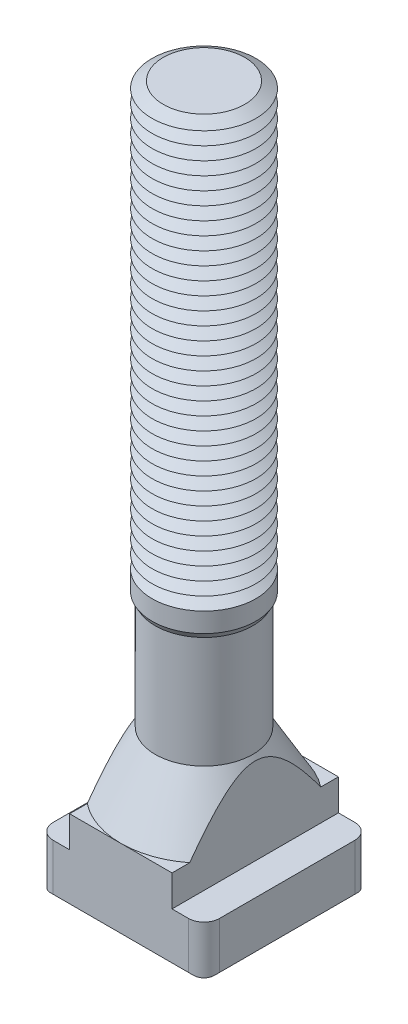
ISO-10303-21;
HEADER;
FILE_DESCRIPTION(('STEP AP214'),'2;1');
FILE_NAME('part.step','',(''),(''),'','','');
FILE_SCHEMA(('AUTOMOTIVE_DESIGN { 1 0 10303 214 1 1 1 1 }'));
ENDSEC;
DATA;
#1=APPLICATION_CONTEXT('core data for automotive mechanical design processes');
#2=APPLICATION_PROTOCOL_DEFINITION('international standard','automotive_design',2000,#1);
#3=PRODUCT_CONTEXT('',#1,'mechanical');
#4=PRODUCT('Part','Part','',(#3));
#5=PRODUCT_RELATED_PRODUCT_CATEGORY('part','',(#4));
#6=PRODUCT_DEFINITION_FORMATION('','',#4);
#7=PRODUCT_DEFINITION_CONTEXT('part definition',#1,'design');
#8=PRODUCT_DEFINITION('design','',#6,#7);
#9=PRODUCT_DEFINITION_SHAPE('','',#8);
#10=(LENGTH_UNIT() NAMED_UNIT(*) SI_UNIT(.MILLI.,.METRE.));
#11=(NAMED_UNIT(*) PLANE_ANGLE_UNIT() SI_UNIT($,.RADIAN.));
#12=(NAMED_UNIT(*) SI_UNIT($,.STERADIAN.) SOLID_ANGLE_UNIT());
#13=UNCERTAINTY_MEASURE_WITH_UNIT(LENGTH_MEASURE(1.E-05),#10,'distance_accuracy_value','');
#14=(GEOMETRIC_REPRESENTATION_CONTEXT(3) GLOBAL_UNCERTAINTY_ASSIGNED_CONTEXT((#13)) GLOBAL_UNIT_ASSIGNED_CONTEXT((#10,
#11,#12)) REPRESENTATION_CONTEXT('',''));
#15=CARTESIAN_POINT('',(0.,0.,0.));
#16=DIRECTION('',(0.,0.,1.));
#17=DIRECTION('',(1.,0.,0.));
#18=AXIS2_PLACEMENT_3D('',#15,#16,#17);
#19=CARTESIAN_POINT('',(0.,127.,0.));
#20=DIRECTION('',(0.,-1.,0.));
#21=DIRECTION('',(0.,0.,-1.));
#22=AXIS2_PLACEMENT_3D('',#19,#20,#21);
#23=CONICAL_SURFACE('',#22,7.83493649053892,1.0471975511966);
#24=CARTESIAN_POINT('',(0.,125.75,0.));
#25=DIRECTION('',(0.,-1.,0.));
#26=DIRECTION('',(0.,0.,-1.));
#27=AXIS2_PLACEMENT_3D('',#24,#25,#26);
#28=CIRCLE('',#27,10.);
#29=CARTESIAN_POINT('',(0.,125.75,-10.));
#30=VERTEX_POINT('',#29);
#31=EDGE_CURVE('E719',#30,#30,#28,.T.);
#32=ORIENTED_EDGE('',*,*,#31,.F.);
#33=EDGE_LOOP('',(#32));
#34=FACE_BOUND('',#33,.T.);
#35=CARTESIAN_POINT('',(0.,127.,0.));
#36=DIRECTION('',(0.,-1.,0.));
#37=DIRECTION('',(0.,0.,-1.));
#38=AXIS2_PLACEMENT_3D('',#35,#36,#37);
#39=CIRCLE('',#38,7.83493649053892);
#40=CARTESIAN_POINT('',(0.,127.,-7.83493649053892));
#41=VERTEX_POINT('',#40);
#42=EDGE_CURVE('E717',#41,#41,#39,.T.);
#43=ORIENTED_EDGE('',*,*,#42,.T.);
#44=EDGE_LOOP('',(#43));
#45=FACE_BOUND('',#44,.T.);
#46=ADVANCED_FACE('F39',(#34,#45),#23,.T.);
#47=CARTESIAN_POINT('',(0.,128.25,0.));
#48=DIRECTION('',(0.,1.,0.));
#49=DIRECTION('',(0.,0.,1.));
#50=AXIS2_PLACEMENT_3D('',#47,#48,#49);
#51=CONICAL_SURFACE('',#50,10.,1.0471975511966);
#52=ORIENTED_EDGE('',*,*,#42,.F.);
#53=EDGE_LOOP('',(#52));
#54=FACE_BOUND('',#53,.T.);
#55=CARTESIAN_POINT('',(0.,128.25,0.));
#56=DIRECTION('',(0.,-1.,0.));
#57=DIRECTION('',(0.,0.,-1.));
#58=AXIS2_PLACEMENT_3D('',#55,#56,#57);
#59=CIRCLE('',#58,10.);
#60=CARTESIAN_POINT('',(0.,128.25,-10.));
#61=VERTEX_POINT('',#60);
#62=EDGE_CURVE('E715',#61,#61,#59,.T.);
#63=ORIENTED_EDGE('',*,*,#62,.T.);
#64=EDGE_LOOP('',(#63));
#65=FACE_BOUND('',#64,.T.);
#66=ADVANCED_FACE('F449',(#54,#65),#51,.T.);
#67=CARTESIAN_POINT('',(4.65424845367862,137.,0.));
#68=DIRECTION('',(0.,-1.,0.));
#69=DIRECTION('',(1.,0.,0.));
#70=AXIS2_PLACEMENT_3D('',#67,#68,#69);
#71=PLANE('',#70);
#72=CARTESIAN_POINT('',(0.,137.,0.));
#73=DIRECTION('',(0.,-1.,0.));
#74=DIRECTION('',(0.,0.,-1.));
#75=AXIS2_PLACEMENT_3D('',#72,#73,#74);
#76=CIRCLE('',#75,7.83493649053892);
#77=CARTESIAN_POINT('',(0.,137.,-7.83493649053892));
#78=VERTEX_POINT('',#77);
#79=EDGE_CURVE('E807',#78,#78,#76,.T.);
#80=ORIENTED_EDGE('',*,*,#79,.F.);
#81=EDGE_LOOP('',(#80));
#82=FACE_BOUND('',#81,.T.);
#83=ADVANCED_FACE('F455',(#82),#71,.F.);
#84=CARTESIAN_POINT('',(0.,137.,0.));
#85=DIRECTION('',(0.,-1.,0.));
#86=DIRECTION('',(0.,0.,-1.));
#87=AXIS2_PLACEMENT_3D('',#84,#85,#86);
#88=CONICAL_SURFACE('',#87,7.83493649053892,1.0471975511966);
#89=CARTESIAN_POINT('',(0.,135.75,0.));
#90=DIRECTION('',(0.,-1.,0.));
#91=DIRECTION('',(0.,0.,-1.));
#92=AXIS2_PLACEMENT_3D('',#89,#90,#91);
#93=CIRCLE('',#92,10.);
#94=CARTESIAN_POINT('',(0.,135.75,-10.));
#95=VERTEX_POINT('',#94);
#96=EDGE_CURVE('E753',#95,#95,#93,.T.);
#97=ORIENTED_EDGE('',*,*,#96,.F.);
#98=EDGE_LOOP('',(#97));
#99=FACE_BOUND('',#98,.T.);
#100=ORIENTED_EDGE('',*,*,#79,.T.);
#101=EDGE_LOOP('',(#100));
#102=FACE_BOUND('',#101,.T.);
#103=ADVANCED_FACE('F483',(#99,#102),#88,.T.);
#104=CARTESIAN_POINT('',(0.,135.75,0.));
#105=DIRECTION('',(0.,1.,0.));
#106=DIRECTION('',(0.,0.,1.));
#107=AXIS2_PLACEMENT_3D('',#104,#105,#106);
#108=CONICAL_SURFACE('',#107,10.,1.0471975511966);
#109=CARTESIAN_POINT('',(0.,134.5,0.));
#110=DIRECTION('',(0.,-1.,0.));
#111=DIRECTION('',(0.,0.,-1.));
#112=AXIS2_PLACEMENT_3D('',#109,#110,#111);
#113=CIRCLE('',#112,7.83493649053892);
#114=CARTESIAN_POINT('',(0.,134.5,-7.83493649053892));
#115=VERTEX_POINT('',#114);
#116=EDGE_CURVE('E751',#115,#115,#113,.T.);
#117=ORIENTED_EDGE('',*,*,#116,.F.);
#118=EDGE_LOOP('',(#117));
#119=FACE_BOUND('',#118,.T.);
#120=ORIENTED_EDGE('',*,*,#96,.T.);
#121=EDGE_LOOP('',(#120));
#122=FACE_BOUND('',#121,.T.);
#123=ADVANCED_FACE('F480',(#119,#122),#108,.T.);
#124=CARTESIAN_POINT('',(0.,134.5,0.));
#125=DIRECTION('',(0.,-1.,0.));
#126=DIRECTION('',(0.,0.,-1.));
#127=AXIS2_PLACEMENT_3D('',#124,#125,#126);
#128=CONICAL_SURFACE('',#127,7.83493649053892,1.0471975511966);
#129=CARTESIAN_POINT('',(0.,133.25,0.));
#130=DIRECTION('',(0.,-1.,0.));
#131=DIRECTION('',(0.,0.,-1.));
#132=AXIS2_PLACEMENT_3D('',#129,#130,#131);
#133=CIRCLE('',#132,10.);
#134=CARTESIAN_POINT('',(0.,133.25,-10.));
#135=VERTEX_POINT('',#134);
#136=EDGE_CURVE('E644',#135,#135,#133,.T.);
#137=ORIENTED_EDGE('',*,*,#136,.F.);
#138=EDGE_LOOP('',(#137));
#139=FACE_BOUND('',#138,.T.);
#140=ORIENTED_EDGE('',*,*,#116,.T.);
#141=EDGE_LOOP('',(#140));
#142=FACE_BOUND('',#141,.T.);
#143=ADVANCED_FACE('F475',(#139,#142),#128,.T.);
#144=CARTESIAN_POINT('',(0.,133.25,0.));
#145=DIRECTION('',(0.,1.,0.));
#146=DIRECTION('',(0.,0.,1.));
#147=AXIS2_PLACEMENT_3D('',#144,#145,#146);
#148=CONICAL_SURFACE('',#147,10.,1.0471975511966);
#149=CARTESIAN_POINT('',(0.,132.,0.));
#150=DIRECTION('',(0.,-1.,0.));
#151=DIRECTION('',(0.,0.,-1.));
#152=AXIS2_PLACEMENT_3D('',#149,#150,#151);
#153=CIRCLE('',#152,7.83493649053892);
#154=CARTESIAN_POINT('',(0.,132.,-7.83493649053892));
#155=VERTEX_POINT('',#154);
#156=EDGE_CURVE('E642',#155,#155,#153,.T.);
#157=ORIENTED_EDGE('',*,*,#156,.F.);
#158=EDGE_LOOP('',(#157));
#159=FACE_BOUND('',#158,.T.);
#160=ORIENTED_EDGE('',*,*,#136,.T.);
#161=EDGE_LOOP('',(#160));
#162=FACE_BOUND('',#161,.T.);
#163=ADVANCED_FACE('F472',(#159,#162),#148,.T.);
#164=CARTESIAN_POINT('',(0.,132.,0.));
#165=DIRECTION('',(0.,-1.,0.));
#166=DIRECTION('',(0.,0.,-1.));
#167=AXIS2_PLACEMENT_3D('',#164,#165,#166);
#168=CONICAL_SURFACE('',#167,7.83493649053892,1.0471975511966);
#169=CARTESIAN_POINT('',(0.,130.75,0.));
#170=DIRECTION('',(0.,-1.,0.));
#171=DIRECTION('',(0.,0.,-1.));
#172=AXIS2_PLACEMENT_3D('',#169,#170,#171);
#173=CIRCLE('',#172,10.);
#174=CARTESIAN_POINT('',(0.,130.75,-10.));
#175=VERTEX_POINT('',#174);
#176=EDGE_CURVE('E645',#175,#175,#173,.T.);
#177=ORIENTED_EDGE('',*,*,#176,.F.);
#178=EDGE_LOOP('',(#177));
#179=FACE_BOUND('',#178,.T.);
#180=ORIENTED_EDGE('',*,*,#156,.T.);
#181=EDGE_LOOP('',(#180));
#182=FACE_BOUND('',#181,.T.);
#183=ADVANCED_FACE('F466',(#179,#182),#168,.T.);
#184=CARTESIAN_POINT('',(0.,130.75,0.));
#185=DIRECTION('',(0.,1.,0.));
#186=DIRECTION('',(0.,0.,1.));
#187=AXIS2_PLACEMENT_3D('',#184,#185,#186);
#188=CONICAL_SURFACE('',#187,10.,1.0471975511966);
#189=CARTESIAN_POINT('',(0.,129.5,0.));
#190=DIRECTION('',(0.,-1.,0.));
#191=DIRECTION('',(0.,0.,-1.));
#192=AXIS2_PLACEMENT_3D('',#189,#190,#191);
#193=CIRCLE('',#192,7.83493649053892);
#194=CARTESIAN_POINT('',(0.,129.5,-7.83493649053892));
#195=VERTEX_POINT('',#194);
#196=EDGE_CURVE('E712',#195,#195,#193,.T.);
#197=ORIENTED_EDGE('',*,*,#196,.F.);
#198=EDGE_LOOP('',(#197));
#199=FACE_BOUND('',#198,.T.);
#200=ORIENTED_EDGE('',*,*,#176,.T.);
#201=EDGE_LOOP('',(#200));
#202=FACE_BOUND('',#201,.T.);
#203=ADVANCED_FACE('F462',(#199,#202),#188,.T.);
#204=CARTESIAN_POINT('',(0.,129.5,0.));
#205=DIRECTION('',(0.,-1.,0.));
#206=DIRECTION('',(0.,0.,-1.));
#207=AXIS2_PLACEMENT_3D('',#204,#205,#206);
#208=CONICAL_SURFACE('',#207,7.83493649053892,1.0471975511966);
#209=ORIENTED_EDGE('',*,*,#62,.F.);
#210=EDGE_LOOP('',(#209));
#211=FACE_BOUND('',#210,.T.);
#212=ORIENTED_EDGE('',*,*,#196,.T.);
#213=EDGE_LOOP('',(#212));
#214=FACE_BOUND('',#213,.T.);
#215=ADVANCED_FACE('F465',(#211,#214),#208,.T.);
#216=CARTESIAN_POINT('',(0.,124.5,0.));
#217=DIRECTION('',(0.,-1.,0.));
#218=DIRECTION('',(0.,0.,-1.));
#219=AXIS2_PLACEMENT_3D('',#216,#217,#218);
#220=CONICAL_SURFACE('',#219,7.83493649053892,1.0471975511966);
#221=CARTESIAN_POINT('',(0.,123.25,0.));
#222=DIRECTION('',(0.,-1.,0.));
#223=DIRECTION('',(0.,0.,-1.));
#224=AXIS2_PLACEMENT_3D('',#221,#222,#223);
#225=CIRCLE('',#224,10.);
#226=CARTESIAN_POINT('',(0.,123.25,-10.));
#227=VERTEX_POINT('',#226);
#228=EDGE_CURVE('E666',#227,#227,#225,.T.);
#229=ORIENTED_EDGE('',*,*,#228,.F.);
#230=EDGE_LOOP('',(#229));
#231=FACE_BOUND('',#230,.T.);
#232=CARTESIAN_POINT('',(0.,124.5,0.));
#233=DIRECTION('',(0.,-1.,0.));
#234=DIRECTION('',(0.,0.,-1.));
#235=AXIS2_PLACEMENT_3D('',#232,#233,#234);
#236=CIRCLE('',#235,7.83493649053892);
#237=CARTESIAN_POINT('',(0.,124.5,-7.83493649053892));
#238=VERTEX_POINT('',#237);
#239=EDGE_CURVE('E668',#238,#238,#236,.T.);
#240=ORIENTED_EDGE('',*,*,#239,.T.);
#241=EDGE_LOOP('',(#240));
#242=FACE_BOUND('',#241,.T.);
#243=ADVANCED_FACE('F470',(#231,#242),#220,.T.);
#244=CARTESIAN_POINT('',(0.,125.75,0.));
#245=DIRECTION('',(0.,1.,0.));
#246=DIRECTION('',(0.,0.,1.));
#247=AXIS2_PLACEMENT_3D('',#244,#245,#246);
#248=CONICAL_SURFACE('',#247,10.,1.0471975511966);
#249=ORIENTED_EDGE('',*,*,#239,.F.);
#250=EDGE_LOOP('',(#249));
#251=FACE_BOUND('',#250,.T.);
#252=ORIENTED_EDGE('',*,*,#31,.T.);
#253=EDGE_LOOP('',(#252));
#254=FACE_BOUND('',#253,.T.);
#255=ADVANCED_FACE('F933',(#251,#254),#248,.T.);
#256=CARTESIAN_POINT('',(0.,122.,0.));
#257=DIRECTION('',(0.,-1.,0.));
#258=DIRECTION('',(0.,0.,-1.));
#259=AXIS2_PLACEMENT_3D('',#256,#257,#258);
#260=CONICAL_SURFACE('',#259,7.83493649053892,1.0471975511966);
#261=CARTESIAN_POINT('',(0.,120.75,0.));
#262=DIRECTION('',(0.,-1.,0.));
#263=DIRECTION('',(0.,0.,-1.));
#264=AXIS2_PLACEMENT_3D('',#261,#262,#263);
#265=CIRCLE('',#264,10.);
#266=CARTESIAN_POINT('',(0.,120.75,-10.));
#267=VERTEX_POINT('',#266);
#268=EDGE_CURVE('E770',#267,#267,#265,.T.);
#269=ORIENTED_EDGE('',*,*,#268,.F.);
#270=EDGE_LOOP('',(#269));
#271=FACE_BOUND('',#270,.T.);
#272=CARTESIAN_POINT('',(0.,122.,0.));
#273=DIRECTION('',(0.,-1.,0.));
#274=DIRECTION('',(0.,0.,-1.));
#275=AXIS2_PLACEMENT_3D('',#272,#273,#274);
#276=CIRCLE('',#275,7.83493649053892);
#277=CARTESIAN_POINT('',(0.,122.,-7.83493649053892));
#278=VERTEX_POINT('',#277);
#279=EDGE_CURVE('E669',#278,#278,#276,.T.);
#280=ORIENTED_EDGE('',*,*,#279,.T.);
#281=EDGE_LOOP('',(#280));
#282=FACE_BOUND('',#281,.T.);
#283=ADVANCED_FACE('F929',(#271,#282),#260,.T.);
#284=CARTESIAN_POINT('',(0.,123.25,0.));
#285=DIRECTION('',(0.,1.,0.));
#286=DIRECTION('',(0.,0.,1.));
#287=AXIS2_PLACEMENT_3D('',#284,#285,#286);
#288=CONICAL_SURFACE('',#287,10.,1.0471975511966);
#289=ORIENTED_EDGE('',*,*,#279,.F.);
#290=EDGE_LOOP('',(#289));
#291=FACE_BOUND('',#290,.T.);
#292=ORIENTED_EDGE('',*,*,#228,.T.);
#293=EDGE_LOOP('',(#292));
#294=FACE_BOUND('',#293,.T.);
#295=ADVANCED_FACE('F925',(#291,#294),#288,.T.);
#296=CARTESIAN_POINT('',(0.,119.5,0.));
#297=DIRECTION('',(0.,-1.,0.));
#298=DIRECTION('',(0.,0.,-1.));
#299=AXIS2_PLACEMENT_3D('',#296,#297,#298);
#300=CONICAL_SURFACE('',#299,7.83493649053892,1.0471975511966);
#301=CARTESIAN_POINT('',(0.,118.25,0.));
#302=DIRECTION('',(0.,-1.,0.));
#303=DIRECTION('',(0.,0.,-1.));
#304=AXIS2_PLACEMENT_3D('',#301,#302,#303);
#305=CIRCLE('',#304,10.);
#306=CARTESIAN_POINT('',(0.,118.25,-10.));
#307=VERTEX_POINT('',#306);
#308=EDGE_CURVE('E771',#307,#307,#305,.T.);
#309=ORIENTED_EDGE('',*,*,#308,.F.);
#310=EDGE_LOOP('',(#309));
#311=FACE_BOUND('',#310,.T.);
#312=CARTESIAN_POINT('',(0.,119.5,0.));
#313=DIRECTION('',(0.,-1.,0.));
#314=DIRECTION('',(0.,0.,-1.));
#315=AXIS2_PLACEMENT_3D('',#312,#313,#314);
#316=CIRCLE('',#315,7.83493649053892);
#317=CARTESIAN_POINT('',(0.,119.5,-7.83493649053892));
#318=VERTEX_POINT('',#317);
#319=EDGE_CURVE('E768',#318,#318,#316,.T.);
#320=ORIENTED_EDGE('',*,*,#319,.T.);
#321=EDGE_LOOP('',(#320));
#322=FACE_BOUND('',#321,.T.);
#323=ADVANCED_FACE('F921',(#311,#322),#300,.T.);
#324=CARTESIAN_POINT('',(0.,120.75,0.));
#325=DIRECTION('',(0.,1.,0.));
#326=DIRECTION('',(0.,0.,1.));
#327=AXIS2_PLACEMENT_3D('',#324,#325,#326);
#328=CONICAL_SURFACE('',#327,10.,1.0471975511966);
#329=ORIENTED_EDGE('',*,*,#319,.F.);
#330=EDGE_LOOP('',(#329));
#331=FACE_BOUND('',#330,.T.);
#332=ORIENTED_EDGE('',*,*,#268,.T.);
#333=EDGE_LOOP('',(#332));
#334=FACE_BOUND('',#333,.T.);
#335=ADVANCED_FACE('F905',(#331,#334),#328,.T.);
#336=CARTESIAN_POINT('',(0.,117.,0.));
#337=DIRECTION('',(0.,-1.,0.));
#338=DIRECTION('',(0.,0.,-1.));
#339=AXIS2_PLACEMENT_3D('',#336,#337,#338);
#340=CONICAL_SURFACE('',#339,7.83493649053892,1.0471975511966);
#341=CARTESIAN_POINT('',(0.,115.75,0.));
#342=DIRECTION('',(0.,-1.,0.));
#343=DIRECTION('',(0.,0.,-1.));
#344=AXIS2_PLACEMENT_3D('',#341,#342,#343);
#345=CIRCLE('',#344,10.);
#346=CARTESIAN_POINT('',(0.,115.75,-10.));
#347=VERTEX_POINT('',#346);
#348=EDGE_CURVE('E780',#347,#347,#345,.T.);
#349=ORIENTED_EDGE('',*,*,#348,.F.);
#350=EDGE_LOOP('',(#349));
#351=FACE_BOUND('',#350,.T.);
#352=CARTESIAN_POINT('',(0.,117.,0.));
#353=DIRECTION('',(0.,-1.,0.));
#354=DIRECTION('',(0.,0.,-1.));
#355=AXIS2_PLACEMENT_3D('',#352,#353,#354);
#356=CIRCLE('',#355,7.83493649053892);
#357=CARTESIAN_POINT('',(0.,117.,-7.83493649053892));
#358=VERTEX_POINT('',#357);
#359=EDGE_CURVE('E774',#358,#358,#356,.T.);
#360=ORIENTED_EDGE('',*,*,#359,.T.);
#361=EDGE_LOOP('',(#360));
#362=FACE_BOUND('',#361,.T.);
#363=ADVANCED_FACE('F901',(#351,#362),#340,.T.);
#364=CARTESIAN_POINT('',(0.,118.25,0.));
#365=DIRECTION('',(0.,1.,0.));
#366=DIRECTION('',(0.,0.,1.));
#367=AXIS2_PLACEMENT_3D('',#364,#365,#366);
#368=CONICAL_SURFACE('',#367,10.,1.0471975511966);
#369=ORIENTED_EDGE('',*,*,#359,.F.);
#370=EDGE_LOOP('',(#369));
#371=FACE_BOUND('',#370,.T.);
#372=ORIENTED_EDGE('',*,*,#308,.T.);
#373=EDGE_LOOP('',(#372));
#374=FACE_BOUND('',#373,.T.);
#375=ADVANCED_FACE('F904',(#371,#374),#368,.T.);
#376=CARTESIAN_POINT('',(0.,114.5,0.));
#377=DIRECTION('',(0.,-1.,0.));
#378=DIRECTION('',(0.,0.,-1.));
#379=AXIS2_PLACEMENT_3D('',#376,#377,#378);
#380=CONICAL_SURFACE('',#379,7.83493649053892,1.0471975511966);
#381=CARTESIAN_POINT('',(0.,113.25,0.));
#382=DIRECTION('',(0.,-1.,0.));
#383=DIRECTION('',(0.,0.,-1.));
#384=AXIS2_PLACEMENT_3D('',#381,#382,#383);
#385=CIRCLE('',#384,10.);
#386=CARTESIAN_POINT('',(0.,113.25,-10.));
#387=VERTEX_POINT('',#386);
#388=EDGE_CURVE('E838',#387,#387,#385,.T.);
#389=ORIENTED_EDGE('',*,*,#388,.F.);
#390=EDGE_LOOP('',(#389));
#391=FACE_BOUND('',#390,.T.);
#392=CARTESIAN_POINT('',(0.,114.5,0.));
#393=DIRECTION('',(0.,-1.,0.));
#394=DIRECTION('',(0.,0.,-1.));
#395=AXIS2_PLACEMENT_3D('',#392,#393,#394);
#396=CIRCLE('',#395,7.83493649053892);
#397=CARTESIAN_POINT('',(0.,114.5,-7.83493649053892));
#398=VERTEX_POINT('',#397);
#399=EDGE_CURVE('E840',#398,#398,#396,.T.);
#400=ORIENTED_EDGE('',*,*,#399,.T.);
#401=EDGE_LOOP('',(#400));
#402=FACE_BOUND('',#401,.T.);
#403=ADVANCED_FACE('F910',(#391,#402),#380,.T.);
#404=CARTESIAN_POINT('',(0.,115.75,0.));
#405=DIRECTION('',(0.,1.,0.));
#406=DIRECTION('',(0.,0.,1.));
#407=AXIS2_PLACEMENT_3D('',#404,#405,#406);
#408=CONICAL_SURFACE('',#407,10.,1.0471975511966);
#409=ORIENTED_EDGE('',*,*,#399,.F.);
#410=EDGE_LOOP('',(#409));
#411=FACE_BOUND('',#410,.T.);
#412=ORIENTED_EDGE('',*,*,#348,.T.);
#413=EDGE_LOOP('',(#412));
#414=FACE_BOUND('',#413,.T.);
#415=ADVANCED_FACE('F899',(#411,#414),#408,.T.);
#416=CARTESIAN_POINT('',(0.,112.,0.));
#417=DIRECTION('',(0.,-1.,0.));
#418=DIRECTION('',(0.,0.,-1.));
#419=AXIS2_PLACEMENT_3D('',#416,#417,#418);
#420=CONICAL_SURFACE('',#419,7.83493649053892,1.0471975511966);
#421=CARTESIAN_POINT('',(0.,110.75,0.));
#422=DIRECTION('',(0.,-1.,0.));
#423=DIRECTION('',(0.,0.,-1.));
#424=AXIS2_PLACEMENT_3D('',#421,#422,#423);
#425=CIRCLE('',#424,10.);
#426=CARTESIAN_POINT('',(0.,110.75,-10.));
#427=VERTEX_POINT('',#426);
#428=EDGE_CURVE('E726',#427,#427,#425,.T.);
#429=ORIENTED_EDGE('',*,*,#428,.F.);
#430=EDGE_LOOP('',(#429));
#431=FACE_BOUND('',#430,.T.);
#432=CARTESIAN_POINT('',(0.,112.,0.));
#433=DIRECTION('',(0.,-1.,0.));
#434=DIRECTION('',(0.,0.,-1.));
#435=AXIS2_PLACEMENT_3D('',#432,#433,#434);
#436=CIRCLE('',#435,7.83493649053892);
#437=CARTESIAN_POINT('',(0.,112.,-7.83493649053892));
#438=VERTEX_POINT('',#437);
#439=EDGE_CURVE('E728',#438,#438,#436,.T.);
#440=ORIENTED_EDGE('',*,*,#439,.T.);
#441=EDGE_LOOP('',(#440));
#442=FACE_BOUND('',#441,.T.);
#443=ADVANCED_FACE('F981',(#431,#442),#420,.T.);
#444=CARTESIAN_POINT('',(0.,113.25,0.));
#445=DIRECTION('',(0.,1.,0.));
#446=DIRECTION('',(0.,0.,1.));
#447=AXIS2_PLACEMENT_3D('',#444,#445,#446);
#448=CONICAL_SURFACE('',#447,10.,1.0471975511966);
#449=ORIENTED_EDGE('',*,*,#439,.F.);
#450=EDGE_LOOP('',(#449));
#451=FACE_BOUND('',#450,.T.);
#452=ORIENTED_EDGE('',*,*,#388,.T.);
#453=EDGE_LOOP('',(#452));
#454=FACE_BOUND('',#453,.T.);
#455=ADVANCED_FACE('F989',(#451,#454),#448,.T.);
#456=CARTESIAN_POINT('',(0.,109.5,0.));
#457=DIRECTION('',(0.,-1.,0.));
#458=DIRECTION('',(0.,0.,-1.));
#459=AXIS2_PLACEMENT_3D('',#456,#457,#458);
#460=CONICAL_SURFACE('',#459,7.83493649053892,1.0471975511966);
#461=CARTESIAN_POINT('',(0.,108.25,0.));
#462=DIRECTION('',(0.,-1.,0.));
#463=DIRECTION('',(0.,0.,-1.));
#464=AXIS2_PLACEMENT_3D('',#461,#462,#463);
#465=CIRCLE('',#464,10.);
#466=CARTESIAN_POINT('',(0.,108.25,-10.));
#467=VERTEX_POINT('',#466);
#468=EDGE_CURVE('E639',#467,#467,#465,.T.);
#469=ORIENTED_EDGE('',*,*,#468,.F.);
#470=EDGE_LOOP('',(#469));
#471=FACE_BOUND('',#470,.T.);
#472=CARTESIAN_POINT('',(0.,109.5,0.));
#473=DIRECTION('',(0.,-1.,0.));
#474=DIRECTION('',(0.,0.,-1.));
#475=AXIS2_PLACEMENT_3D('',#472,#473,#474);
#476=CIRCLE('',#475,7.83493649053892);
#477=CARTESIAN_POINT('',(0.,109.5,-7.83493649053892));
#478=VERTEX_POINT('',#477);
#479=EDGE_CURVE('E729',#478,#478,#476,.T.);
#480=ORIENTED_EDGE('',*,*,#479,.T.);
#481=EDGE_LOOP('',(#480));
#482=FACE_BOUND('',#481,.T.);
#483=ADVANCED_FACE('F998',(#471,#482),#460,.T.);
#484=CARTESIAN_POINT('',(0.,110.75,0.));
#485=DIRECTION('',(0.,1.,0.));
#486=DIRECTION('',(0.,0.,1.));
#487=AXIS2_PLACEMENT_3D('',#484,#485,#486);
#488=CONICAL_SURFACE('',#487,10.,1.0471975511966);
#489=ORIENTED_EDGE('',*,*,#479,.F.);
#490=EDGE_LOOP('',(#489));
#491=FACE_BOUND('',#490,.T.);
#492=ORIENTED_EDGE('',*,*,#428,.T.);
#493=EDGE_LOOP('',(#492));
#494=FACE_BOUND('',#493,.T.);
#495=ADVANCED_FACE('F1007',(#491,#494),#488,.T.);
#496=CARTESIAN_POINT('',(0.,107.,0.));
#497=DIRECTION('',(0.,-1.,0.));
#498=DIRECTION('',(0.,0.,-1.));
#499=AXIS2_PLACEMENT_3D('',#496,#497,#498);
#500=CONICAL_SURFACE('',#499,7.83493649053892,1.0471975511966);
#501=CARTESIAN_POINT('',(0.,105.75,0.));
#502=DIRECTION('',(0.,-1.,0.));
#503=DIRECTION('',(0.,0.,-1.));
#504=AXIS2_PLACEMENT_3D('',#501,#502,#503);
#505=CIRCLE('',#504,10.);
#506=CARTESIAN_POINT('',(0.,105.75,-10.));
#507=VERTEX_POINT('',#506);
#508=EDGE_CURVE('E640',#507,#507,#505,.T.);
#509=ORIENTED_EDGE('',*,*,#508,.F.);
#510=EDGE_LOOP('',(#509));
#511=FACE_BOUND('',#510,.T.);
#512=CARTESIAN_POINT('',(0.,107.,0.));
#513=DIRECTION('',(0.,-1.,0.));
#514=DIRECTION('',(0.,0.,-1.));
#515=AXIS2_PLACEMENT_3D('',#512,#513,#514);
#516=CIRCLE('',#515,7.83493649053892);
#517=CARTESIAN_POINT('',(0.,107.,-7.83493649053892));
#518=VERTEX_POINT('',#517);
#519=EDGE_CURVE('E636',#518,#518,#516,.T.);
#520=ORIENTED_EDGE('',*,*,#519,.T.);
#521=EDGE_LOOP('',(#520));
#522=FACE_BOUND('',#521,.T.);
#523=ADVANCED_FACE('F1016',(#511,#522),#500,.T.);
#524=CARTESIAN_POINT('',(0.,108.25,0.));
#525=DIRECTION('',(0.,1.,0.));
#526=DIRECTION('',(0.,0.,1.));
#527=AXIS2_PLACEMENT_3D('',#524,#525,#526);
#528=CONICAL_SURFACE('',#527,10.,1.0471975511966);
#529=ORIENTED_EDGE('',*,*,#519,.F.);
#530=EDGE_LOOP('',(#529));
#531=FACE_BOUND('',#530,.T.);
#532=ORIENTED_EDGE('',*,*,#468,.T.);
#533=EDGE_LOOP('',(#532));
#534=FACE_BOUND('',#533,.T.);
#535=ADVANCED_FACE('F1025',(#531,#534),#528,.T.);
#536=CARTESIAN_POINT('',(0.,104.5,0.));
#537=DIRECTION('',(0.,-1.,0.));
#538=DIRECTION('',(0.,0.,-1.));
#539=AXIS2_PLACEMENT_3D('',#536,#537,#538);
#540=CONICAL_SURFACE('',#539,7.83493649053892,1.0471975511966);
#541=CARTESIAN_POINT('',(0.,103.25,0.));
#542=DIRECTION('',(0.,-1.,0.));
#543=DIRECTION('',(0.,0.,-1.));
#544=AXIS2_PLACEMENT_3D('',#541,#542,#543);
#545=CIRCLE('',#544,10.);
#546=CARTESIAN_POINT('',(0.,103.25,-10.));
#547=VERTEX_POINT('',#546);
#548=EDGE_CURVE('E745',#547,#547,#545,.T.);
#549=ORIENTED_EDGE('',*,*,#548,.F.);
#550=EDGE_LOOP('',(#549));
#551=FACE_BOUND('',#550,.T.);
#552=CARTESIAN_POINT('',(0.,104.5,0.));
#553=DIRECTION('',(0.,-1.,0.));
#554=DIRECTION('',(0.,0.,-1.));
#555=AXIS2_PLACEMENT_3D('',#552,#553,#554);
#556=CIRCLE('',#555,7.83493649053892);
#557=CARTESIAN_POINT('',(0.,104.5,-7.83493649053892));
#558=VERTEX_POINT('',#557);
#559=EDGE_CURVE('E880',#558,#558,#556,.T.);
#560=ORIENTED_EDGE('',*,*,#559,.T.);
#561=EDGE_LOOP('',(#560));
#562=FACE_BOUND('',#561,.T.);
#563=ADVANCED_FACE('F1034',(#551,#562),#540,.T.);
#564=CARTESIAN_POINT('',(0.,105.75,0.));
#565=DIRECTION('',(0.,1.,0.));
#566=DIRECTION('',(0.,0.,1.));
#567=AXIS2_PLACEMENT_3D('',#564,#565,#566);
#568=CONICAL_SURFACE('',#567,10.,1.0471975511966);
#569=ORIENTED_EDGE('',*,*,#559,.F.);
#570=EDGE_LOOP('',(#569));
#571=FACE_BOUND('',#570,.T.);
#572=ORIENTED_EDGE('',*,*,#508,.T.);
#573=EDGE_LOOP('',(#572));
#574=FACE_BOUND('',#573,.T.);
#575=ADVANCED_FACE('F1043',(#571,#574),#568,.T.);
#576=CARTESIAN_POINT('',(0.,102.,0.));
#577=DIRECTION('',(0.,-1.,0.));
#578=DIRECTION('',(0.,0.,-1.));
#579=AXIS2_PLACEMENT_3D('',#576,#577,#578);
#580=CONICAL_SURFACE('',#579,7.83493649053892,1.0471975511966);
#581=CARTESIAN_POINT('',(0.,100.75,0.));
#582=DIRECTION('',(0.,-1.,0.));
#583=DIRECTION('',(0.,0.,-1.));
#584=AXIS2_PLACEMENT_3D('',#581,#582,#583);
#585=CIRCLE('',#584,10.);
#586=CARTESIAN_POINT('',(0.,100.75,-10.));
#587=VERTEX_POINT('',#586);
#588=EDGE_CURVE('E746',#587,#587,#585,.T.);
#589=ORIENTED_EDGE('',*,*,#588,.F.);
#590=EDGE_LOOP('',(#589));
#591=FACE_BOUND('',#590,.T.);
#592=CARTESIAN_POINT('',(0.,102.,0.));
#593=DIRECTION('',(0.,-1.,0.));
#594=DIRECTION('',(0.,0.,-1.));
#595=AXIS2_PLACEMENT_3D('',#592,#593,#594);
#596=CIRCLE('',#595,7.83493649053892);
#597=CARTESIAN_POINT('',(0.,102.,-7.83493649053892));
#598=VERTEX_POINT('',#597);
#599=EDGE_CURVE('E742',#598,#598,#596,.T.);
#600=ORIENTED_EDGE('',*,*,#599,.T.);
#601=EDGE_LOOP('',(#600));
#602=FACE_BOUND('',#601,.T.);
#603=ADVANCED_FACE('F1052',(#591,#602),#580,.T.);
#604=CARTESIAN_POINT('',(0.,103.25,0.));
#605=DIRECTION('',(0.,1.,0.));
#606=DIRECTION('',(0.,0.,1.));
#607=AXIS2_PLACEMENT_3D('',#604,#605,#606);
#608=CONICAL_SURFACE('',#607,10.,1.0471975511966);
#609=ORIENTED_EDGE('',*,*,#599,.F.);
#610=EDGE_LOOP('',(#609));
#611=FACE_BOUND('',#610,.T.);
#612=ORIENTED_EDGE('',*,*,#548,.T.);
#613=EDGE_LOOP('',(#612));
#614=FACE_BOUND('',#613,.T.);
#615=ADVANCED_FACE('F1061',(#611,#614),#608,.T.);
#616=CARTESIAN_POINT('',(0.,99.5,0.));
#617=DIRECTION('',(0.,-1.,0.));
#618=DIRECTION('',(0.,0.,-1.));
#619=AXIS2_PLACEMENT_3D('',#616,#617,#618);
#620=CONICAL_SURFACE('',#619,7.83493649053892,1.0471975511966);
#621=CARTESIAN_POINT('',(0.,98.25,0.));
#622=DIRECTION('',(0.,-1.,0.));
#623=DIRECTION('',(0.,0.,-1.));
#624=AXIS2_PLACEMENT_3D('',#621,#622,#623);
#625=CIRCLE('',#624,10.);
#626=CARTESIAN_POINT('',(0.,98.25,-10.));
#627=VERTEX_POINT('',#626);
#628=EDGE_CURVE('E709',#627,#627,#625,.T.);
#629=ORIENTED_EDGE('',*,*,#628,.F.);
#630=EDGE_LOOP('',(#629));
#631=FACE_BOUND('',#630,.T.);
#632=CARTESIAN_POINT('',(0.,99.5,0.));
#633=DIRECTION('',(0.,-1.,0.));
#634=DIRECTION('',(0.,0.,-1.));
#635=AXIS2_PLACEMENT_3D('',#632,#633,#634);
#636=CIRCLE('',#635,7.83493649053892);
#637=CARTESIAN_POINT('',(0.,99.5,-7.83493649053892));
#638=VERTEX_POINT('',#637);
#639=EDGE_CURVE('E827',#638,#638,#636,.T.);
#640=ORIENTED_EDGE('',*,*,#639,.T.);
#641=EDGE_LOOP('',(#640));
#642=FACE_BOUND('',#641,.T.);
#643=ADVANCED_FACE('F1070',(#631,#642),#620,.T.);
#644=CARTESIAN_POINT('',(0.,100.75,0.));
#645=DIRECTION('',(0.,1.,0.));
#646=DIRECTION('',(0.,0.,1.));
#647=AXIS2_PLACEMENT_3D('',#644,#645,#646);
#648=CONICAL_SURFACE('',#647,10.,1.0471975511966);
#649=ORIENTED_EDGE('',*,*,#639,.F.);
#650=EDGE_LOOP('',(#649));
#651=FACE_BOUND('',#650,.T.);
#652=ORIENTED_EDGE('',*,*,#588,.T.);
#653=EDGE_LOOP('',(#652));
#654=FACE_BOUND('',#653,.T.);
#655=ADVANCED_FACE('F1079',(#651,#654),#648,.T.);
#656=CARTESIAN_POINT('',(0.,97.,0.));
#657=DIRECTION('',(0.,-1.,0.));
#658=DIRECTION('',(0.,0.,-1.));
#659=AXIS2_PLACEMENT_3D('',#656,#657,#658);
#660=CONICAL_SURFACE('',#659,7.83493649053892,1.0471975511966);
#661=CARTESIAN_POINT('',(0.,95.75,0.));
#662=DIRECTION('',(0.,-1.,0.));
#663=DIRECTION('',(0.,0.,-1.));
#664=AXIS2_PLACEMENT_3D('',#661,#662,#663);
#665=CIRCLE('',#664,10.);
#666=CARTESIAN_POINT('',(0.,95.75,-10.));
#667=VERTEX_POINT('',#666);
#668=EDGE_CURVE('E710',#667,#667,#665,.T.);
#669=ORIENTED_EDGE('',*,*,#668,.F.);
#670=EDGE_LOOP('',(#669));
#671=FACE_BOUND('',#670,.T.);
#672=CARTESIAN_POINT('',(0.,97.,0.));
#673=DIRECTION('',(0.,-1.,0.));
#674=DIRECTION('',(0.,0.,-1.));
#675=AXIS2_PLACEMENT_3D('',#672,#673,#674);
#676=CIRCLE('',#675,7.83493649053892);
#677=CARTESIAN_POINT('',(0.,97.,-7.83493649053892));
#678=VERTEX_POINT('',#677);
#679=EDGE_CURVE('E706',#678,#678,#676,.T.);
#680=ORIENTED_EDGE('',*,*,#679,.T.);
#681=EDGE_LOOP('',(#680));
#682=FACE_BOUND('',#681,.T.);
#683=ADVANCED_FACE('F1088',(#671,#682),#660,.T.);
#684=CARTESIAN_POINT('',(0.,98.25,0.));
#685=DIRECTION('',(0.,1.,0.));
#686=DIRECTION('',(0.,0.,1.));
#687=AXIS2_PLACEMENT_3D('',#684,#685,#686);
#688=CONICAL_SURFACE('',#687,10.,1.0471975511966);
#689=ORIENTED_EDGE('',*,*,#679,.F.);
#690=EDGE_LOOP('',(#689));
#691=FACE_BOUND('',#690,.T.);
#692=ORIENTED_EDGE('',*,*,#628,.T.);
#693=EDGE_LOOP('',(#692));
#694=FACE_BOUND('',#693,.T.);
#695=ADVANCED_FACE('F1097',(#691,#694),#688,.T.);
#696=CARTESIAN_POINT('',(0.,94.5,0.));
#697=DIRECTION('',(0.,-1.,0.));
#698=DIRECTION('',(0.,0.,-1.));
#699=AXIS2_PLACEMENT_3D('',#696,#697,#698);
#700=CONICAL_SURFACE('',#699,7.83493649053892,1.0471975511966);
#701=CARTESIAN_POINT('',(0.,93.25,0.));
#702=DIRECTION('',(0.,-1.,0.));
#703=DIRECTION('',(0.,0.,-1.));
#704=AXIS2_PLACEMENT_3D('',#701,#702,#703);
#705=CIRCLE('',#704,10.);
#706=CARTESIAN_POINT('',(0.,93.25,-10.));
#707=VERTEX_POINT('',#706);
#708=EDGE_CURVE('E660',#707,#707,#705,.T.);
#709=ORIENTED_EDGE('',*,*,#708,.F.);
#710=EDGE_LOOP('',(#709));
#711=FACE_BOUND('',#710,.T.);
#712=CARTESIAN_POINT('',(0.,94.5,0.));
#713=DIRECTION('',(0.,-1.,0.));
#714=DIRECTION('',(0.,0.,-1.));
#715=AXIS2_PLACEMENT_3D('',#712,#713,#714);
#716=CIRCLE('',#715,7.83493649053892);
#717=CARTESIAN_POINT('',(0.,94.5,-7.83493649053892));
#718=VERTEX_POINT('',#717);
#719=EDGE_CURVE('E663',#718,#718,#716,.T.);
#720=ORIENTED_EDGE('',*,*,#719,.T.);
#721=EDGE_LOOP('',(#720));
#722=FACE_BOUND('',#721,.T.);
#723=ADVANCED_FACE('F1106',(#711,#722),#700,.T.);
#724=CARTESIAN_POINT('',(0.,95.75,0.));
#725=DIRECTION('',(0.,1.,0.));
#726=DIRECTION('',(0.,0.,1.));
#727=AXIS2_PLACEMENT_3D('',#724,#725,#726);
#728=CONICAL_SURFACE('',#727,10.,1.0471975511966);
#729=ORIENTED_EDGE('',*,*,#719,.F.);
#730=EDGE_LOOP('',(#729));
#731=FACE_BOUND('',#730,.T.);
#732=ORIENTED_EDGE('',*,*,#668,.T.);
#733=EDGE_LOOP('',(#732));
#734=FACE_BOUND('',#733,.T.);
#735=ADVANCED_FACE('F1115',(#731,#734),#728,.T.);
#736=CARTESIAN_POINT('',(0.,92.,0.));
#737=DIRECTION('',(0.,-1.,0.));
#738=DIRECTION('',(0.,0.,-1.));
#739=AXIS2_PLACEMENT_3D('',#736,#737,#738);
#740=CONICAL_SURFACE('',#739,7.83493649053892,1.0471975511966);
#741=CARTESIAN_POINT('',(0.,90.75,0.));
#742=DIRECTION('',(0.,-1.,0.));
#743=DIRECTION('',(0.,0.,-1.));
#744=AXIS2_PLACEMENT_3D('',#741,#742,#743);
#745=CIRCLE('',#744,10.);
#746=CARTESIAN_POINT('',(0.,90.75,-10.));
#747=VERTEX_POINT('',#746);
#748=EDGE_CURVE('E862',#747,#747,#745,.T.);
#749=ORIENTED_EDGE('',*,*,#748,.F.);
#750=EDGE_LOOP('',(#749));
#751=FACE_BOUND('',#750,.T.);
#752=CARTESIAN_POINT('',(0.,92.,0.));
#753=DIRECTION('',(0.,-1.,0.));
#754=DIRECTION('',(0.,0.,-1.));
#755=AXIS2_PLACEMENT_3D('',#752,#753,#754);
#756=CIRCLE('',#755,7.83493649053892);
#757=CARTESIAN_POINT('',(0.,92.,-7.83493649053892));
#758=VERTEX_POINT('',#757);
#759=EDGE_CURVE('E664',#758,#758,#756,.T.);
#760=ORIENTED_EDGE('',*,*,#759,.T.);
#761=EDGE_LOOP('',(#760));
#762=FACE_BOUND('',#761,.T.);
#763=ADVANCED_FACE('F1124',(#751,#762),#740,.T.);
#764=CARTESIAN_POINT('',(0.,93.25,0.));
#765=DIRECTION('',(0.,1.,0.));
#766=DIRECTION('',(0.,0.,1.));
#767=AXIS2_PLACEMENT_3D('',#764,#765,#766);
#768=CONICAL_SURFACE('',#767,10.,1.0471975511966);
#769=ORIENTED_EDGE('',*,*,#759,.F.);
#770=EDGE_LOOP('',(#769));
#771=FACE_BOUND('',#770,.T.);
#772=ORIENTED_EDGE('',*,*,#708,.T.);
#773=EDGE_LOOP('',(#772));
#774=FACE_BOUND('',#773,.T.);
#775=ADVANCED_FACE('F1133',(#771,#774),#768,.T.);
#776=CARTESIAN_POINT('',(0.,89.5,0.));
#777=DIRECTION('',(0.,-1.,0.));
#778=DIRECTION('',(0.,0.,-1.));
#779=AXIS2_PLACEMENT_3D('',#776,#777,#778);
#780=CONICAL_SURFACE('',#779,7.83493649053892,1.0471975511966);
#781=CARTESIAN_POINT('',(0.,88.25,0.));
#782=DIRECTION('',(0.,-1.,0.));
#783=DIRECTION('',(0.,0.,-1.));
#784=AXIS2_PLACEMENT_3D('',#781,#782,#783);
#785=CIRCLE('',#784,10.);
#786=CARTESIAN_POINT('',(0.,88.25,-10.));
#787=VERTEX_POINT('',#786);
#788=EDGE_CURVE('E762',#787,#787,#785,.T.);
#789=ORIENTED_EDGE('',*,*,#788,.F.);
#790=EDGE_LOOP('',(#789));
#791=FACE_BOUND('',#790,.T.);
#792=CARTESIAN_POINT('',(0.,89.5,0.));
#793=DIRECTION('',(0.,-1.,0.));
#794=DIRECTION('',(0.,0.,-1.));
#795=AXIS2_PLACEMENT_3D('',#792,#793,#794);
#796=CIRCLE('',#795,7.83493649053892);
#797=CARTESIAN_POINT('',(0.,89.5,-7.83493649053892));
#798=VERTEX_POINT('',#797);
#799=EDGE_CURVE('E765',#798,#798,#796,.T.);
#800=ORIENTED_EDGE('',*,*,#799,.T.);
#801=EDGE_LOOP('',(#800));
#802=FACE_BOUND('',#801,.T.);
#803=ADVANCED_FACE('F1142',(#791,#802),#780,.T.);
#804=CARTESIAN_POINT('',(0.,90.75,0.));
#805=DIRECTION('',(0.,1.,0.));
#806=DIRECTION('',(0.,0.,1.));
#807=AXIS2_PLACEMENT_3D('',#804,#805,#806);
#808=CONICAL_SURFACE('',#807,10.,1.0471975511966);
#809=ORIENTED_EDGE('',*,*,#799,.F.);
#810=EDGE_LOOP('',(#809));
#811=FACE_BOUND('',#810,.T.);
#812=ORIENTED_EDGE('',*,*,#748,.T.);
#813=EDGE_LOOP('',(#812));
#814=FACE_BOUND('',#813,.T.);
#815=ADVANCED_FACE('F1151',(#811,#814),#808,.T.);
#816=CARTESIAN_POINT('',(0.,87.,0.));
#817=DIRECTION('',(0.,-1.,0.));
#818=DIRECTION('',(0.,0.,-1.));
#819=AXIS2_PLACEMENT_3D('',#816,#817,#818);
#820=CONICAL_SURFACE('',#819,7.83493649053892,1.0471975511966);
#821=CARTESIAN_POINT('',(0.,85.75,0.));
#822=DIRECTION('',(0.,-1.,0.));
#823=DIRECTION('',(0.,0.,-1.));
#824=AXIS2_PLACEMENT_3D('',#821,#822,#823);
#825=CIRCLE('',#824,10.);
#826=CARTESIAN_POINT('',(0.,85.75,-10.));
#827=VERTEX_POINT('',#826);
#828=EDGE_CURVE('E657',#827,#827,#825,.T.);
#829=ORIENTED_EDGE('',*,*,#828,.F.);
#830=EDGE_LOOP('',(#829));
#831=FACE_BOUND('',#830,.T.);
#832=CARTESIAN_POINT('',(0.,87.,0.));
#833=DIRECTION('',(0.,-1.,0.));
#834=DIRECTION('',(0.,0.,-1.));
#835=AXIS2_PLACEMENT_3D('',#832,#833,#834);
#836=CIRCLE('',#835,7.83493649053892);
#837=CARTESIAN_POINT('',(0.,87.,-7.83493649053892));
#838=VERTEX_POINT('',#837);
#839=EDGE_CURVE('E766',#838,#838,#836,.T.);
#840=ORIENTED_EDGE('',*,*,#839,.T.);
#841=EDGE_LOOP('',(#840));
#842=FACE_BOUND('',#841,.T.);
#843=ADVANCED_FACE('F1160',(#831,#842),#820,.T.);
#844=CARTESIAN_POINT('',(0.,88.25,0.));
#845=DIRECTION('',(0.,1.,0.));
#846=DIRECTION('',(0.,0.,1.));
#847=AXIS2_PLACEMENT_3D('',#844,#845,#846);
#848=CONICAL_SURFACE('',#847,10.,1.0471975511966);
#849=ORIENTED_EDGE('',*,*,#839,.F.);
#850=EDGE_LOOP('',(#849));
#851=FACE_BOUND('',#850,.T.);
#852=ORIENTED_EDGE('',*,*,#788,.T.);
#853=EDGE_LOOP('',(#852));
#854=FACE_BOUND('',#853,.T.);
#855=ADVANCED_FACE('F1169',(#851,#854),#848,.T.);
#856=CARTESIAN_POINT('',(0.,84.5,0.));
#857=DIRECTION('',(0.,-1.,0.));
#858=DIRECTION('',(0.,0.,-1.));
#859=AXIS2_PLACEMENT_3D('',#856,#857,#858);
#860=CONICAL_SURFACE('',#859,7.83493649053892,1.0471975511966);
#861=CARTESIAN_POINT('',(0.,83.25,0.));
#862=DIRECTION('',(0.,-1.,0.));
#863=DIRECTION('',(0.,0.,-1.));
#864=AXIS2_PLACEMENT_3D('',#861,#862,#863);
#865=CIRCLE('',#864,10.);
#866=CARTESIAN_POINT('',(0.,83.25,-10.));
#867=VERTEX_POINT('',#866);
#868=EDGE_CURVE('E658',#867,#867,#865,.T.);
#869=ORIENTED_EDGE('',*,*,#868,.F.);
#870=EDGE_LOOP('',(#869));
#871=FACE_BOUND('',#870,.T.);
#872=CARTESIAN_POINT('',(0.,84.5,0.));
#873=DIRECTION('',(0.,-1.,0.));
#874=DIRECTION('',(0.,0.,-1.));
#875=AXIS2_PLACEMENT_3D('',#872,#873,#874);
#876=CIRCLE('',#875,7.83493649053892);
#877=CARTESIAN_POINT('',(0.,84.5,-7.83493649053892));
#878=VERTEX_POINT('',#877);
#879=EDGE_CURVE('E654',#878,#878,#876,.T.);
#880=ORIENTED_EDGE('',*,*,#879,.T.);
#881=EDGE_LOOP('',(#880));
#882=FACE_BOUND('',#881,.T.);
#883=ADVANCED_FACE('F1178',(#871,#882),#860,.T.);
#884=CARTESIAN_POINT('',(0.,85.75,0.));
#885=DIRECTION('',(0.,1.,0.));
#886=DIRECTION('',(0.,0.,1.));
#887=AXIS2_PLACEMENT_3D('',#884,#885,#886);
#888=CONICAL_SURFACE('',#887,10.,1.0471975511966);
#889=ORIENTED_EDGE('',*,*,#879,.F.);
#890=EDGE_LOOP('',(#889));
#891=FACE_BOUND('',#890,.T.);
#892=ORIENTED_EDGE('',*,*,#828,.T.);
#893=EDGE_LOOP('',(#892));
#894=FACE_BOUND('',#893,.T.);
#895=ADVANCED_FACE('F1187',(#891,#894),#888,.T.);
#896=CARTESIAN_POINT('',(0.,82.,0.));
#897=DIRECTION('',(0.,-1.,0.));
#898=DIRECTION('',(0.,0.,-1.));
#899=AXIS2_PLACEMENT_3D('',#896,#897,#898);
#900=CONICAL_SURFACE('',#899,7.83493649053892,1.0471975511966);
#901=CARTESIAN_POINT('',(0.,80.75,0.));
#902=DIRECTION('',(0.,-1.,0.));
#903=DIRECTION('',(0.,0.,-1.));
#904=AXIS2_PLACEMENT_3D('',#901,#902,#903);
#905=CIRCLE('',#904,10.);
#906=CARTESIAN_POINT('',(0.,80.75,-10.));
#907=VERTEX_POINT('',#906);
#908=EDGE_CURVE('E1811',#907,#907,#905,.T.);
#909=ORIENTED_EDGE('',*,*,#908,.F.);
#910=EDGE_LOOP('',(#909));
#911=FACE_BOUND('',#910,.T.);
#912=CARTESIAN_POINT('',(0.,82.,0.));
#913=DIRECTION('',(0.,-1.,0.));
#914=DIRECTION('',(0.,0.,-1.));
#915=AXIS2_PLACEMENT_3D('',#912,#913,#914);
#916=CIRCLE('',#915,7.83493649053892);
#917=CARTESIAN_POINT('',(0.,82.,-7.83493649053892));
#918=VERTEX_POINT('',#917);
#919=EDGE_CURVE('E724',#918,#918,#916,.T.);
#920=ORIENTED_EDGE('',*,*,#919,.T.);
#921=EDGE_LOOP('',(#920));
#922=FACE_BOUND('',#921,.T.);
#923=ADVANCED_FACE('F1196',(#911,#922),#900,.T.);
#924=CARTESIAN_POINT('',(0.,83.25,0.));
#925=DIRECTION('',(0.,1.,0.));
#926=DIRECTION('',(0.,0.,1.));
#927=AXIS2_PLACEMENT_3D('',#924,#925,#926);
#928=CONICAL_SURFACE('',#927,10.,1.0471975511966);
#929=ORIENTED_EDGE('',*,*,#919,.F.);
#930=EDGE_LOOP('',(#929));
#931=FACE_BOUND('',#930,.T.);
#932=ORIENTED_EDGE('',*,*,#868,.T.);
#933=EDGE_LOOP('',(#932));
#934=FACE_BOUND('',#933,.T.);
#935=ADVANCED_FACE('F1205',(#931,#934),#928,.T.);
#936=CARTESIAN_POINT('',(0.,79.5,0.));
#937=DIRECTION('',(0.,-1.,0.));
#938=DIRECTION('',(0.,0.,-1.));
#939=AXIS2_PLACEMENT_3D('',#936,#937,#938);
#940=CONICAL_SURFACE('',#939,7.83493649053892,1.0471975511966);
#941=CARTESIAN_POINT('',(0.,78.25,0.));
#942=DIRECTION('',(0.,-1.,0.));
#943=DIRECTION('',(0.,0.,-1.));
#944=AXIS2_PLACEMENT_3D('',#941,#942,#943);
#945=CIRCLE('',#944,10.);
#946=CARTESIAN_POINT('',(0.,78.25,-10.));
#947=VERTEX_POINT('',#946);
#948=EDGE_CURVE('E847',#947,#947,#945,.T.);
#949=ORIENTED_EDGE('',*,*,#948,.F.);
#950=EDGE_LOOP('',(#949));
#951=FACE_BOUND('',#950,.T.);
#952=CARTESIAN_POINT('',(0.,79.5,0.));
#953=DIRECTION('',(0.,-1.,0.));
#954=DIRECTION('',(0.,0.,-1.));
#955=AXIS2_PLACEMENT_3D('',#952,#953,#954);
#956=CIRCLE('',#955,7.83493649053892);
#957=CARTESIAN_POINT('',(0.,79.5,-7.83493649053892));
#958=VERTEX_POINT('',#957);
#959=EDGE_CURVE('E850',#958,#958,#956,.T.);
#960=ORIENTED_EDGE('',*,*,#959,.T.);
#961=EDGE_LOOP('',(#960));
#962=FACE_BOUND('',#961,.T.);
#963=ADVANCED_FACE('F1214',(#951,#962),#940,.T.);
#964=CARTESIAN_POINT('',(0.,80.75,0.));
#965=DIRECTION('',(0.,1.,0.));
#966=DIRECTION('',(0.,0.,1.));
#967=AXIS2_PLACEMENT_3D('',#964,#965,#966);
#968=CONICAL_SURFACE('',#967,10.,1.0471975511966);
#969=ORIENTED_EDGE('',*,*,#959,.F.);
#970=EDGE_LOOP('',(#969));
#971=FACE_BOUND('',#970,.T.);
#972=ORIENTED_EDGE('',*,*,#908,.T.);
#973=EDGE_LOOP('',(#972));
#974=FACE_BOUND('',#973,.T.);
#975=ADVANCED_FACE('F1223',(#971,#974),#968,.T.);
#976=CARTESIAN_POINT('',(0.,77.,0.));
#977=DIRECTION('',(0.,-1.,0.));
#978=DIRECTION('',(0.,0.,-1.));
#979=AXIS2_PLACEMENT_3D('',#976,#977,#978);
#980=CONICAL_SURFACE('',#979,7.83493649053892,1.0471975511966);
#981=CARTESIAN_POINT('',(0.,75.75,0.));
#982=DIRECTION('',(0.,-1.,0.));
#983=DIRECTION('',(0.,0.,-1.));
#984=AXIS2_PLACEMENT_3D('',#981,#982,#983);
#985=CIRCLE('',#984,10.);
#986=CARTESIAN_POINT('',(0.,75.75,-10.));
#987=VERTEX_POINT('',#986);
#988=EDGE_CURVE('E736',#987,#987,#985,.T.);
#989=ORIENTED_EDGE('',*,*,#988,.F.);
#990=EDGE_LOOP('',(#989));
#991=FACE_BOUND('',#990,.T.);
#992=CARTESIAN_POINT('',(0.,77.,0.));
#993=DIRECTION('',(0.,-1.,0.));
#994=DIRECTION('',(0.,0.,-1.));
#995=AXIS2_PLACEMENT_3D('',#992,#993,#994);
#996=CIRCLE('',#995,7.83493649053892);
#997=CARTESIAN_POINT('',(0.,77.,-7.83493649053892));
#998=VERTEX_POINT('',#997);
#999=EDGE_CURVE('E739',#998,#998,#996,.T.);
#1000=ORIENTED_EDGE('',*,*,#999,.T.);
#1001=EDGE_LOOP('',(#1000));
#1002=FACE_BOUND('',#1001,.T.);
#1003=ADVANCED_FACE('F1232',(#991,#1002),#980,.T.);
#1004=CARTESIAN_POINT('',(0.,78.25,0.));
#1005=DIRECTION('',(0.,1.,0.));
#1006=DIRECTION('',(0.,0.,1.));
#1007=AXIS2_PLACEMENT_3D('',#1004,#1005,#1006);
#1008=CONICAL_SURFACE('',#1007,10.,1.0471975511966);
#1009=ORIENTED_EDGE('',*,*,#999,.F.);
#1010=EDGE_LOOP('',(#1009));
#1011=FACE_BOUND('',#1010,.T.);
#1012=ORIENTED_EDGE('',*,*,#948,.T.);
#1013=EDGE_LOOP('',(#1012));
#1014=FACE_BOUND('',#1013,.T.);
#1015=ADVANCED_FACE('F1241',(#1011,#1014),#1008,.T.);
#1016=CARTESIAN_POINT('',(0.,74.5,0.));
#1017=DIRECTION('',(0.,-1.,0.));
#1018=DIRECTION('',(0.,0.,-1.));
#1019=AXIS2_PLACEMENT_3D('',#1016,#1017,#1018);
#1020=CONICAL_SURFACE('',#1019,7.83493649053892,1.0471975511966);
#1021=CARTESIAN_POINT('',(0.,73.25,0.));
#1022=DIRECTION('',(0.,-1.,0.));
#1023=DIRECTION('',(0.,0.,-1.));
#1024=AXIS2_PLACEMENT_3D('',#1021,#1022,#1023);
#1025=CIRCLE('',#1024,10.);
#1026=CARTESIAN_POINT('',(0.,73.25,-10.));
#1027=VERTEX_POINT('',#1026);
#1028=EDGE_CURVE('E651',#1027,#1027,#1025,.T.);
#1029=ORIENTED_EDGE('',*,*,#1028,.F.);
#1030=EDGE_LOOP('',(#1029));
#1031=FACE_BOUND('',#1030,.T.);
#1032=CARTESIAN_POINT('',(0.,74.5,0.));
#1033=DIRECTION('',(0.,-1.,0.));
#1034=DIRECTION('',(0.,0.,-1.));
#1035=AXIS2_PLACEMENT_3D('',#1032,#1033,#1034);
#1036=CIRCLE('',#1035,7.83493649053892);
#1037=CARTESIAN_POINT('',(0.,74.5,-7.83493649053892));
#1038=VERTEX_POINT('',#1037);
#1039=EDGE_CURVE('E740',#1038,#1038,#1036,.T.);
#1040=ORIENTED_EDGE('',*,*,#1039,.T.);
#1041=EDGE_LOOP('',(#1040));
#1042=FACE_BOUND('',#1041,.T.);
#1043=ADVANCED_FACE('F1250',(#1031,#1042),#1020,.T.);
#1044=CARTESIAN_POINT('',(0.,75.75,0.));
#1045=DIRECTION('',(0.,1.,0.));
#1046=DIRECTION('',(0.,0.,1.));
#1047=AXIS2_PLACEMENT_3D('',#1044,#1045,#1046);
#1048=CONICAL_SURFACE('',#1047,10.,1.0471975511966);
#1049=ORIENTED_EDGE('',*,*,#1039,.F.);
#1050=EDGE_LOOP('',(#1049));
#1051=FACE_BOUND('',#1050,.T.);
#1052=ORIENTED_EDGE('',*,*,#988,.T.);
#1053=EDGE_LOOP('',(#1052));
#1054=FACE_BOUND('',#1053,.T.);
#1055=ADVANCED_FACE('F1259',(#1051,#1054),#1048,.T.);
#1056=CARTESIAN_POINT('',(0.,72.,0.));
#1057=DIRECTION('',(0.,-1.,0.));
#1058=DIRECTION('',(0.,0.,-1.));
#1059=AXIS2_PLACEMENT_3D('',#1056,#1057,#1058);
#1060=CONICAL_SURFACE('',#1059,7.83493649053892,1.0471975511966);
#1061=CARTESIAN_POINT('',(0.,70.75,0.));
#1062=DIRECTION('',(0.,-1.,0.));
#1063=DIRECTION('',(0.,0.,-1.));
#1064=AXIS2_PLACEMENT_3D('',#1061,#1062,#1063);
#1065=CIRCLE('',#1064,10.);
#1066=CARTESIAN_POINT('',(0.,70.75,-10.));
#1067=VERTEX_POINT('',#1066);
#1068=EDGE_CURVE('E652',#1067,#1067,#1065,.T.);
#1069=ORIENTED_EDGE('',*,*,#1068,.F.);
#1070=EDGE_LOOP('',(#1069));
#1071=FACE_BOUND('',#1070,.T.);
#1072=CARTESIAN_POINT('',(0.,72.,0.));
#1073=DIRECTION('',(0.,-1.,0.));
#1074=DIRECTION('',(0.,0.,-1.));
#1075=AXIS2_PLACEMENT_3D('',#1072,#1073,#1074);
#1076=CIRCLE('',#1075,7.83493649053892);
#1077=CARTESIAN_POINT('',(0.,72.,-7.83493649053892));
#1078=VERTEX_POINT('',#1077);
#1079=EDGE_CURVE('E648',#1078,#1078,#1076,.T.);
#1080=ORIENTED_EDGE('',*,*,#1079,.T.);
#1081=EDGE_LOOP('',(#1080));
#1082=FACE_BOUND('',#1081,.T.);
#1083=ADVANCED_FACE('F1268',(#1071,#1082),#1060,.T.);
#1084=CARTESIAN_POINT('',(0.,73.25,0.));
#1085=DIRECTION('',(0.,1.,0.));
#1086=DIRECTION('',(0.,0.,1.));
#1087=AXIS2_PLACEMENT_3D('',#1084,#1085,#1086);
#1088=CONICAL_SURFACE('',#1087,10.,1.0471975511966);
#1089=ORIENTED_EDGE('',*,*,#1079,.F.);
#1090=EDGE_LOOP('',(#1089));
#1091=FACE_BOUND('',#1090,.T.);
#1092=ORIENTED_EDGE('',*,*,#1028,.T.);
#1093=EDGE_LOOP('',(#1092));
#1094=FACE_BOUND('',#1093,.T.);
#1095=ADVANCED_FACE('F1277',(#1091,#1094),#1088,.T.);
#1096=CARTESIAN_POINT('',(0.,69.5,0.));
#1097=DIRECTION('',(0.,-1.,0.));
#1098=DIRECTION('',(0.,0.,-1.));
#1099=AXIS2_PLACEMENT_3D('',#1096,#1097,#1098);
#1100=CONICAL_SURFACE('',#1099,7.83493649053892,1.0471975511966);
#1101=CARTESIAN_POINT('',(0.,68.25,0.));
#1102=DIRECTION('',(0.,-1.,0.));
#1103=DIRECTION('',(0.,0.,-1.));
#1104=AXIS2_PLACEMENT_3D('',#1101,#1102,#1103);
#1105=CIRCLE('',#1104,10.);
#1106=CARTESIAN_POINT('',(0.,68.25,-10.));
#1107=VERTEX_POINT('',#1106);
#1108=EDGE_CURVE('E759',#1107,#1107,#1105,.T.);
#1109=ORIENTED_EDGE('',*,*,#1108,.F.);
#1110=EDGE_LOOP('',(#1109));
#1111=FACE_BOUND('',#1110,.T.);
#1112=CARTESIAN_POINT('',(0.,69.5,0.));
#1113=DIRECTION('',(0.,-1.,0.));
#1114=DIRECTION('',(0.,0.,-1.));
#1115=AXIS2_PLACEMENT_3D('',#1112,#1113,#1114);
#1116=CIRCLE('',#1115,7.83493649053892);
#1117=CARTESIAN_POINT('',(0.,69.5,-7.83493649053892));
#1118=VERTEX_POINT('',#1117);
#1119=EDGE_CURVE('E704',#1118,#1118,#1116,.T.);
#1120=ORIENTED_EDGE('',*,*,#1119,.T.);
#1121=EDGE_LOOP('',(#1120));
#1122=FACE_BOUND('',#1121,.T.);
#1123=ADVANCED_FACE('F1286',(#1111,#1122),#1100,.T.);
#1124=CARTESIAN_POINT('',(0.,70.75,0.));
#1125=DIRECTION('',(0.,1.,0.));
#1126=DIRECTION('',(0.,0.,1.));
#1127=AXIS2_PLACEMENT_3D('',#1124,#1125,#1126);
#1128=CONICAL_SURFACE('',#1127,10.,1.0471975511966);
#1129=ORIENTED_EDGE('',*,*,#1119,.F.);
#1130=EDGE_LOOP('',(#1129));
#1131=FACE_BOUND('',#1130,.T.);
#1132=ORIENTED_EDGE('',*,*,#1068,.T.);
#1133=EDGE_LOOP('',(#1132));
#1134=FACE_BOUND('',#1133,.T.);
#1135=ADVANCED_FACE('F1295',(#1131,#1134),#1128,.T.);
#1136=CARTESIAN_POINT('',(0.,67.,0.));
#1137=DIRECTION('',(0.,-1.,0.));
#1138=DIRECTION('',(0.,0.,-1.));
#1139=AXIS2_PLACEMENT_3D('',#1136,#1137,#1138);
#1140=CONICAL_SURFACE('',#1139,7.83493649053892,1.0471975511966);
#1141=CARTESIAN_POINT('',(0.,65.75,0.));
#1142=DIRECTION('',(0.,-1.,0.));
#1143=DIRECTION('',(0.,0.,-1.));
#1144=AXIS2_PLACEMENT_3D('',#1141,#1142,#1143);
#1145=CIRCLE('',#1144,10.);
#1146=CARTESIAN_POINT('',(0.,65.75,-10.));
#1147=VERTEX_POINT('',#1146);
#1148=EDGE_CURVE('E760',#1147,#1147,#1145,.T.);
#1149=ORIENTED_EDGE('',*,*,#1148,.F.);
#1150=EDGE_LOOP('',(#1149));
#1151=FACE_BOUND('',#1150,.T.);
#1152=CARTESIAN_POINT('',(0.,67.,0.));
#1153=DIRECTION('',(0.,-1.,0.));
#1154=DIRECTION('',(0.,0.,-1.));
#1155=AXIS2_PLACEMENT_3D('',#1152,#1153,#1154);
#1156=CIRCLE('',#1155,7.83493649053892);
#1157=CARTESIAN_POINT('',(0.,67.,-7.83493649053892));
#1158=VERTEX_POINT('',#1157);
#1159=EDGE_CURVE('E756',#1158,#1158,#1156,.T.);
#1160=ORIENTED_EDGE('',*,*,#1159,.T.);
#1161=EDGE_LOOP('',(#1160));
#1162=FACE_BOUND('',#1161,.T.);
#1163=ADVANCED_FACE('F1304',(#1151,#1162),#1140,.T.);
#1164=CARTESIAN_POINT('',(0.,68.25,0.));
#1165=DIRECTION('',(0.,1.,0.));
#1166=DIRECTION('',(0.,0.,1.));
#1167=AXIS2_PLACEMENT_3D('',#1164,#1165,#1166);
#1168=CONICAL_SURFACE('',#1167,10.,1.0471975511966);
#1169=ORIENTED_EDGE('',*,*,#1159,.F.);
#1170=EDGE_LOOP('',(#1169));
#1171=FACE_BOUND('',#1170,.T.);
#1172=ORIENTED_EDGE('',*,*,#1108,.T.);
#1173=EDGE_LOOP('',(#1172));
#1174=FACE_BOUND('',#1173,.T.);
#1175=ADVANCED_FACE('F1313',(#1171,#1174),#1168,.T.);
#1176=CARTESIAN_POINT('',(0.,64.5,0.));
#1177=DIRECTION('',(0.,-1.,0.));
#1178=DIRECTION('',(0.,0.,-1.));
#1179=AXIS2_PLACEMENT_3D('',#1176,#1177,#1178);
#1180=CONICAL_SURFACE('',#1179,7.83493649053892,1.0471975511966);
#1181=CARTESIAN_POINT('',(0.,63.25,0.));
#1182=DIRECTION('',(0.,-1.,0.));
#1183=DIRECTION('',(0.,0.,-1.));
#1184=AXIS2_PLACEMENT_3D('',#1181,#1182,#1183);
#1185=CIRCLE('',#1184,10.);
#1186=CARTESIAN_POINT('',(0.,63.25,-10.));
#1187=VERTEX_POINT('',#1186);
#1188=EDGE_CURVE('E833',#1187,#1187,#1185,.T.);
#1189=ORIENTED_EDGE('',*,*,#1188,.F.);
#1190=EDGE_LOOP('',(#1189));
#1191=FACE_BOUND('',#1190,.T.);
#1192=CARTESIAN_POINT('',(0.,64.5,0.));
#1193=DIRECTION('',(0.,-1.,0.));
#1194=DIRECTION('',(0.,0.,-1.));
#1195=AXIS2_PLACEMENT_3D('',#1192,#1193,#1194);
#1196=CIRCLE('',#1195,7.83493649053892);
#1197=CARTESIAN_POINT('',(0.,64.5,-7.83493649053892));
#1198=VERTEX_POINT('',#1197);
#1199=EDGE_CURVE('E843',#1198,#1198,#1196,.T.);
#1200=ORIENTED_EDGE('',*,*,#1199,.T.);
#1201=EDGE_LOOP('',(#1200));
#1202=FACE_BOUND('',#1201,.T.);
#1203=ADVANCED_FACE('F1322',(#1191,#1202),#1180,.T.);
#1204=CARTESIAN_POINT('',(0.,65.75,0.));
#1205=DIRECTION('',(0.,1.,0.));
#1206=DIRECTION('',(0.,0.,1.));
#1207=AXIS2_PLACEMENT_3D('',#1204,#1205,#1206);
#1208=CONICAL_SURFACE('',#1207,10.,1.0471975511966);
#1209=ORIENTED_EDGE('',*,*,#1199,.F.);
#1210=EDGE_LOOP('',(#1209));
#1211=FACE_BOUND('',#1210,.T.);
#1212=ORIENTED_EDGE('',*,*,#1148,.T.);
#1213=EDGE_LOOP('',(#1212));
#1214=FACE_BOUND('',#1213,.T.);
#1215=ADVANCED_FACE('F1331',(#1211,#1214),#1208,.T.);
#1216=CARTESIAN_POINT('',(0.,62.,0.));
#1217=DIRECTION('',(0.,-1.,0.));
#1218=DIRECTION('',(0.,0.,-1.));
#1219=AXIS2_PLACEMENT_3D('',#1216,#1217,#1218);
#1220=CONICAL_SURFACE('',#1219,7.83493649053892,1.0471975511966);
#1221=CARTESIAN_POINT('',(0.,60.75,0.));
#1222=DIRECTION('',(0.,-1.,0.));
#1223=DIRECTION('',(0.,0.,-1.));
#1224=AXIS2_PLACEMENT_3D('',#1221,#1222,#1223);
#1225=CIRCLE('',#1224,10.);
#1226=CARTESIAN_POINT('',(0.,60.75,-10.));
#1227=VERTEX_POINT('',#1226);
#1228=EDGE_CURVE('E699',#1227,#1227,#1225,.T.);
#1229=ORIENTED_EDGE('',*,*,#1228,.F.);
#1230=EDGE_LOOP('',(#1229));
#1231=FACE_BOUND('',#1230,.T.);
#1232=CARTESIAN_POINT('',(0.,62.,0.));
#1233=DIRECTION('',(0.,-1.,0.));
#1234=DIRECTION('',(0.,0.,-1.));
#1235=AXIS2_PLACEMENT_3D('',#1232,#1233,#1234);
#1236=CIRCLE('',#1235,7.83493649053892);
#1237=CARTESIAN_POINT('',(0.,62.,-7.83493649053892));
#1238=VERTEX_POINT('',#1237);
#1239=EDGE_CURVE('E734',#1238,#1238,#1236,.T.);
#1240=ORIENTED_EDGE('',*,*,#1239,.T.);
#1241=EDGE_LOOP('',(#1240));
#1242=FACE_BOUND('',#1241,.T.);
#1243=ADVANCED_FACE('F1340',(#1231,#1242),#1220,.T.);
#1244=CARTESIAN_POINT('',(0.,63.25,0.));
#1245=DIRECTION('',(0.,1.,0.));
#1246=DIRECTION('',(0.,0.,1.));
#1247=AXIS2_PLACEMENT_3D('',#1244,#1245,#1246);
#1248=CONICAL_SURFACE('',#1247,10.,1.0471975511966);
#1249=ORIENTED_EDGE('',*,*,#1239,.F.);
#1250=EDGE_LOOP('',(#1249));
#1251=FACE_BOUND('',#1250,.T.);
#1252=ORIENTED_EDGE('',*,*,#1188,.T.);
#1253=EDGE_LOOP('',(#1252));
#1254=FACE_BOUND('',#1253,.T.);
#1255=ADVANCED_FACE('F1349',(#1251,#1254),#1248,.T.);
#1256=CARTESIAN_POINT('',(0.,59.5,0.));
#1257=DIRECTION('',(0.,-1.,0.));
#1258=DIRECTION('',(0.,0.,-1.));
#1259=AXIS2_PLACEMENT_3D('',#1256,#1257,#1258);
#1260=CONICAL_SURFACE('',#1259,7.83493649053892,1.0471975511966);
#1261=CARTESIAN_POINT('',(0.,58.25,0.));
#1262=DIRECTION('',(0.,-1.,0.));
#1263=DIRECTION('',(0.,0.,-1.));
#1264=AXIS2_PLACEMENT_3D('',#1261,#1262,#1263);
#1265=CIRCLE('',#1264,10.);
#1266=CARTESIAN_POINT('',(0.,58.25,-10.));
#1267=VERTEX_POINT('',#1266);
#1268=EDGE_CURVE('E694',#1267,#1267,#1265,.T.);
#1269=ORIENTED_EDGE('',*,*,#1268,.F.);
#1270=EDGE_LOOP('',(#1269));
#1271=FACE_BOUND('',#1270,.T.);
#1272=CARTESIAN_POINT('',(0.,59.5,0.));
#1273=DIRECTION('',(0.,-1.,0.));
#1274=DIRECTION('',(0.,0.,-1.));
#1275=AXIS2_PLACEMENT_3D('',#1272,#1273,#1274);
#1276=CIRCLE('',#1275,7.83493649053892);
#1277=CARTESIAN_POINT('',(0.,59.5,-7.83493649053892));
#1278=VERTEX_POINT('',#1277);
#1279=EDGE_CURVE('E696',#1278,#1278,#1276,.T.);
#1280=ORIENTED_EDGE('',*,*,#1279,.T.);
#1281=EDGE_LOOP('',(#1280));
#1282=FACE_BOUND('',#1281,.T.);
#1283=ADVANCED_FACE('F1358',(#1271,#1282),#1260,.T.);
#1284=CARTESIAN_POINT('',(0.,60.75,0.));
#1285=DIRECTION('',(0.,1.,0.));
#1286=DIRECTION('',(0.,0.,1.));
#1287=AXIS2_PLACEMENT_3D('',#1284,#1285,#1286);
#1288=CONICAL_SURFACE('',#1287,10.,1.0471975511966);
#1289=ORIENTED_EDGE('',*,*,#1279,.F.);
#1290=EDGE_LOOP('',(#1289));
#1291=FACE_BOUND('',#1290,.T.);
#1292=ORIENTED_EDGE('',*,*,#1228,.T.);
#1293=EDGE_LOOP('',(#1292));
#1294=FACE_BOUND('',#1293,.T.);
#1295=ADVANCED_FACE('F1367',(#1291,#1294),#1288,.T.);
#1296=CARTESIAN_POINT('',(0.,57.,0.));
#1297=DIRECTION('',(0.,-1.,0.));
#1298=DIRECTION('',(0.,0.,-1.));
#1299=AXIS2_PLACEMENT_3D('',#1296,#1297,#1298);
#1300=CONICAL_SURFACE('',#1299,7.83493649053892,1.0471975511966);
#1301=CARTESIAN_POINT('',(0.,55.75,0.));
#1302=DIRECTION('',(0.,-1.,0.));
#1303=DIRECTION('',(0.,0.,-1.));
#1304=AXIS2_PLACEMENT_3D('',#1301,#1302,#1303);
#1305=CIRCLE('',#1304,10.);
#1306=CARTESIAN_POINT('',(0.,55.75,-10.));
#1307=VERTEX_POINT('',#1306);
#1308=EDGE_CURVE('E700',#1307,#1307,#1305,.T.);
#1309=ORIENTED_EDGE('',*,*,#1308,.F.);
#1310=EDGE_LOOP('',(#1309));
#1311=FACE_BOUND('',#1310,.T.);
#1312=CARTESIAN_POINT('',(0.,57.,0.));
#1313=DIRECTION('',(0.,-1.,0.));
#1314=DIRECTION('',(0.,0.,-1.));
#1315=AXIS2_PLACEMENT_3D('',#1312,#1313,#1314);
#1316=CIRCLE('',#1315,7.83493649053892);
#1317=CARTESIAN_POINT('',(0.,57.,-7.83493649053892));
#1318=VERTEX_POINT('',#1317);
#1319=EDGE_CURVE('E691',#1318,#1318,#1316,.T.);
#1320=ORIENTED_EDGE('',*,*,#1319,.T.);
#1321=EDGE_LOOP('',(#1320));
#1322=FACE_BOUND('',#1321,.T.);
#1323=ADVANCED_FACE('F567',(#1311,#1322),#1300,.T.);
#1324=CARTESIAN_POINT('',(0.,58.25,0.));
#1325=DIRECTION('',(0.,1.,0.));
#1326=DIRECTION('',(0.,0.,1.));
#1327=AXIS2_PLACEMENT_3D('',#1324,#1325,#1326);
#1328=CONICAL_SURFACE('',#1327,10.,1.0471975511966);
#1329=ORIENTED_EDGE('',*,*,#1319,.F.);
#1330=EDGE_LOOP('',(#1329));
#1331=FACE_BOUND('',#1330,.T.);
#1332=ORIENTED_EDGE('',*,*,#1268,.T.);
#1333=EDGE_LOOP('',(#1332));
#1334=FACE_BOUND('',#1333,.T.);
#1335=ADVANCED_FACE('F562',(#1331,#1334),#1328,.T.);
#1336=CARTESIAN_POINT('',(-14.5857864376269,5.82842712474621,-14.5857864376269));
#1337=DIRECTION('',(-0.577350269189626,0.577350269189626,-0.577350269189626));
#1338=DIRECTION('',(-0.707106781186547,0.,0.707106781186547));
#1339=AXIS2_PLACEMENT_3D('',#1336,#1337,#1338);
#1340=CYLINDRICAL_SURFACE('',#1339,3.);
#1341=CARTESIAN_POINT('',(-8.7573593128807,0.,-8.7573593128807));
#1342=DIRECTION('',(0.,1.,0.));
#1343=DIRECTION('',(-0.707106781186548,0.,-0.707106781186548));
#1344=AXIS2_PLACEMENT_3D('',#1341,#1342,#1343);
#1345=ELLIPSE('',#1344,5.19615242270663,3.);
#1346=CARTESIAN_POINT('',(-13.,0.,-10.8786796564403));
#1347=VERTEX_POINT('',#1346);
#1348=CARTESIAN_POINT('',(-10.8786796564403,0.,-13.));
#1349=VERTEX_POINT('',#1348);
#1350=EDGE_CURVE('E325',#1347,#1349,#1345,.F.);
#1351=ORIENTED_EDGE('',*,*,#1350,.F.);
#1352=DIRECTION('',(0.577350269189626,-0.577350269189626,0.577350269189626));
#1353=VECTOR('',#1352,1.);
#1354=CARTESIAN_POINT('',(-6.04044011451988,-6.9595598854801,-3.91911977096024));
#1355=LINE('',#1354,#1353);
#1356=CARTESIAN_POINT('',(-15.8977774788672,2.89777747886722,-13.7764571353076));
#1357=VERTEX_POINT('',#1356);
#1358=EDGE_CURVE('E366',#1357,#1347,#1355,.T.);
#1359=ORIENTED_EDGE('',*,*,#1358,.F.);
#1360=CARTESIAN_POINT('',(-13.,4.2426406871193,-13.));
#1361=DIRECTION('',(0.325057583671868,-0.888073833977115,0.325057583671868));
#1362=DIRECTION('',(-0.627963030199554,-0.459700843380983,-0.627963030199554));
#1363=AXIS2_PLACEMENT_3D('',#1360,#1361,#1362);
#1364=ELLIPSE('',#1363,3.37809750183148,3.);
#1365=CARTESIAN_POINT('',(-13.7764571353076,2.89777747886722,-15.8977774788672));
#1366=VERTEX_POINT('',#1365);
#1367=EDGE_CURVE('E263',#1357,#1366,#1364,.T.);
#1368=ORIENTED_EDGE('',*,*,#1367,.T.);
#1369=DIRECTION('',(0.577350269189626,-0.577350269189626,0.577350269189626));
#1370=VECTOR('',#1369,1.);
#1371=CARTESIAN_POINT('',(-14.5857864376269,3.70710678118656,-16.7071067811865));
#1372=LINE('',#1371,#1370);
#1373=EDGE_CURVE('E359',#1349,#1366,#1372,.F.);
#1374=ORIENTED_EDGE('',*,*,#1373,.F.);
#1375=EDGE_LOOP('',(#1351,#1359,#1368,#1374));
#1376=FACE_BOUND('',#1375,.T.);
#1377=ADVANCED_FACE('F551',(#1376),#1340,.T.);
#1378=CARTESIAN_POINT('',(3.91911977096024,-4.83823954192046,-3.91911977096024));
#1379=DIRECTION('',(0.577350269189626,0.577350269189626,-0.577350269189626));
#1380=DIRECTION('',(-0.707106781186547,0.,-0.707106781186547));
#1381=AXIS2_PLACEMENT_3D('',#1378,#1379,#1380);
#1382=CYLINDRICAL_SURFACE('',#1381,3.);
#1383=CARTESIAN_POINT('',(8.7573593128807,0.,-8.75735931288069));
#1384=DIRECTION('',(0.,1.,0.));
#1385=DIRECTION('',(0.707106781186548,0.,-0.707106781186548));
#1386=AXIS2_PLACEMENT_3D('',#1383,#1384,#1385);
#1387=ELLIPSE('',#1386,5.19615242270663,3.);
#1388=CARTESIAN_POINT('',(10.8786796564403,0.,-13.));
#1389=VERTEX_POINT('',#1388);
#1390=CARTESIAN_POINT('',(13.,0.,-10.8786796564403));
#1391=VERTEX_POINT('',#1390);
#1392=EDGE_CURVE('E331',#1389,#1391,#1387,.F.);
#1393=ORIENTED_EDGE('',*,*,#1392,.F.);
#1394=DIRECTION('',(-0.577350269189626,-0.577350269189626,0.577350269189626));
#1395=VECTOR('',#1394,1.);
#1396=CARTESIAN_POINT('',(3.91911977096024,-6.9595598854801,-6.04044011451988));
#1397=LINE('',#1396,#1395);
#1398=CARTESIAN_POINT('',(13.7764571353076,2.89777747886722,-15.8977774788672));
#1399=VERTEX_POINT('',#1398);
#1400=EDGE_CURVE('E353',#1399,#1389,#1397,.T.);
#1401=ORIENTED_EDGE('',*,*,#1400,.F.);
#1402=CARTESIAN_POINT('',(13.,4.2426406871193,-13.));
#1403=DIRECTION('',(-0.325057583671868,-0.888073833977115,0.325057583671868));
#1404=DIRECTION('',(0.627963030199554,-0.459700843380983,-0.627963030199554));
#1405=AXIS2_PLACEMENT_3D('',#1402,#1403,#1404);
#1406=ELLIPSE('',#1405,3.37809750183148,3.);
#1407=CARTESIAN_POINT('',(15.8977774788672,2.89777747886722,-13.7764571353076));
#1408=VERTEX_POINT('',#1407);
#1409=EDGE_CURVE('E407',#1399,#1408,#1406,.T.);
#1410=ORIENTED_EDGE('',*,*,#1409,.T.);
#1411=DIRECTION('',(-0.577350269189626,-0.577350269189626,0.577350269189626));
#1412=VECTOR('',#1411,1.);
#1413=CARTESIAN_POINT('',(6.04044011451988,-6.9595598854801,-3.91911977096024));
#1414=LINE('',#1413,#1412);
#1415=EDGE_CURVE('E321',#1391,#1408,#1414,.F.);
#1416=ORIENTED_EDGE('',*,*,#1415,.F.);
#1417=EDGE_LOOP('',(#1393,#1401,#1410,#1416));
#1418=FACE_BOUND('',#1417,.T.);
#1419=ADVANCED_FACE('F547',(#1418),#1382,.T.);
#1420=CARTESIAN_POINT('',(16.,0.,-16.));
#1421=DIRECTION('',(0.,1.,0.));
#1422=DIRECTION('',(0.,0.,1.));
#1423=AXIS2_PLACEMENT_3D('',#1420,#1421,#1422);
#1424=PLANE('',#1423);
#1425=DIRECTION('',(0.,0.,1.));
#1426=VECTOR('',#1425,1.);
#1427=CARTESIAN_POINT('',(13.,0.,-16.));
#1428=LINE('',#1427,#1426);
#1429=CARTESIAN_POINT('',(13.,0.,10.8786796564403));
#1430=VERTEX_POINT('',#1429);
#1431=EDGE_CURVE('E295',#1391,#1430,#1428,.T.);
#1432=ORIENTED_EDGE('',*,*,#1431,.T.);
#1433=CARTESIAN_POINT('',(8.7573593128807,0.,8.7573593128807));
#1434=DIRECTION('',(0.,1.,0.));
#1435=DIRECTION('',(-0.707106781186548,0.,-0.707106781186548));
#1436=AXIS2_PLACEMENT_3D('',#1433,#1434,#1435);
#1437=ELLIPSE('',#1436,5.19615242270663,3.);
#1438=CARTESIAN_POINT('',(10.8786796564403,0.,13.));
#1439=VERTEX_POINT('',#1438);
#1440=EDGE_CURVE('E334',#1430,#1439,#1437,.F.);
#1441=ORIENTED_EDGE('',*,*,#1440,.T.);
#1442=DIRECTION('',(-1.,0.,0.));
#1443=VECTOR('',#1442,1.);
#1444=CARTESIAN_POINT('',(16.,0.,13.));
#1445=LINE('',#1444,#1443);
#1446=CARTESIAN_POINT('',(-10.8786796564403,0.,13.));
#1447=VERTEX_POINT('',#1446);
#1448=EDGE_CURVE('E282',#1439,#1447,#1445,.T.);
#1449=ORIENTED_EDGE('',*,*,#1448,.T.);
#1450=CARTESIAN_POINT('',(-8.7573593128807,0.,8.7573593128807));
#1451=DIRECTION('',(0.,1.,0.));
#1452=DIRECTION('',(0.707106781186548,0.,-0.707106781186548));
#1453=AXIS2_PLACEMENT_3D('',#1450,#1451,#1452);
#1454=ELLIPSE('',#1453,5.19615242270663,3.);
#1455=CARTESIAN_POINT('',(-13.,0.,10.8786796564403));
#1456=VERTEX_POINT('',#1455);
#1457=EDGE_CURVE('E328',#1447,#1456,#1454,.F.);
#1458=ORIENTED_EDGE('',*,*,#1457,.T.);
#1459=DIRECTION('',(0.,0.,-1.));
#1460=VECTOR('',#1459,1.);
#1461=CARTESIAN_POINT('',(-13.,0.,-16.));
#1462=LINE('',#1461,#1460);
#1463=EDGE_CURVE('E287',#1456,#1347,#1462,.T.);
#1464=ORIENTED_EDGE('',*,*,#1463,.T.);
#1465=ORIENTED_EDGE('',*,*,#1350,.T.);
#1466=DIRECTION('',(1.,0.,0.));
#1467=VECTOR('',#1466,1.);
#1468=CARTESIAN_POINT('',(16.,0.,-13.));
#1469=LINE('',#1468,#1467);
#1470=EDGE_CURVE('E291',#1349,#1389,#1469,.T.);
#1471=ORIENTED_EDGE('',*,*,#1470,.T.);
#1472=ORIENTED_EDGE('',*,*,#1392,.T.);
#1473=EDGE_LOOP('',(#1432,#1441,#1449,#1458,#1464,#1465,#1471,#1472));
#1474=FACE_BOUND('',#1473,.T.);
#1475=ADVANCED_FACE('F550',(#1474),#1424,.F.);
#1476=CARTESIAN_POINT('',(-14.5857864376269,5.82842712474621,14.5857864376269));
#1477=DIRECTION('',(0.577350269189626,-0.577350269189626,-0.577350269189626));
#1478=DIRECTION('',(-0.707106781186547,0.,-0.707106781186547));
#1479=AXIS2_PLACEMENT_3D('',#1476,#1477,#1478);
#1480=CYLINDRICAL_SURFACE('',#1479,3.);
#1481=CARTESIAN_POINT('',(-13.,4.2426406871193,13.));
#1482=DIRECTION('',(0.325057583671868,-0.888073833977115,-0.325057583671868));
#1483=DIRECTION('',(-0.627963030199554,-0.459700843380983,0.627963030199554));
#1484=AXIS2_PLACEMENT_3D('',#1481,#1482,#1483);
#1485=ELLIPSE('',#1484,3.37809750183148,3.);
#1486=CARTESIAN_POINT('',(-13.7764571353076,2.89777747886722,15.8977774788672));
#1487=VERTEX_POINT('',#1486);
#1488=CARTESIAN_POINT('',(-15.8977774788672,2.89777747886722,13.7764571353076));
#1489=VERTEX_POINT('',#1488);
#1490=EDGE_CURVE('E410',#1487,#1489,#1485,.T.);
#1491=ORIENTED_EDGE('',*,*,#1490,.T.);
#1492=DIRECTION('',(-0.577350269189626,0.577350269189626,0.577350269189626));
#1493=VECTOR('',#1492,1.);
#1494=CARTESIAN_POINT('',(-16.7071067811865,3.70710678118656,14.5857864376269));
#1495=LINE('',#1494,#1493);
#1496=EDGE_CURVE('E372',#1456,#1489,#1495,.T.);
#1497=ORIENTED_EDGE('',*,*,#1496,.F.);
#1498=ORIENTED_EDGE('',*,*,#1457,.F.);
#1499=DIRECTION('',(-0.577350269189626,0.577350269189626,0.577350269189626));
#1500=VECTOR('',#1499,1.);
#1501=CARTESIAN_POINT('',(-14.5857864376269,3.70710678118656,16.7071067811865));
#1502=LINE('',#1501,#1500);
#1503=EDGE_CURVE('E346',#1487,#1447,#1502,.F.);
#1504=ORIENTED_EDGE('',*,*,#1503,.F.);
#1505=EDGE_LOOP('',(#1491,#1497,#1498,#1504));
#1506=FACE_BOUND('',#1505,.T.);
#1507=ADVANCED_FACE('F542',(#1506),#1480,.T.);
#1508=CARTESIAN_POINT('',(-16.,3.00000000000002,16.));
#1509=DIRECTION('',(0.707106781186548,0.707106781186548,0.));
#1510=DIRECTION('',(-0.707106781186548,0.707106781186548,0.));
#1511=AXIS2_PLACEMENT_3D('',#1508,#1509,#1510);
#1512=PLANE('',#1511);
#1513=ORIENTED_EDGE('',*,*,#1463,.F.);
#1514=ORIENTED_EDGE('',*,*,#1496,.T.);
#1515=CARTESIAN_POINT('',(-13.,0.,13.));
#1516=DIRECTION('',(0.707106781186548,0.707106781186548,0.));
#1517=DIRECTION('',(0.707106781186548,-0.707106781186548,0.));
#1518=AXIS2_PLACEMENT_3D('',#1515,#1516,#1517);
#1519=ELLIPSE('',#1518,4.24264068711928,3.);
#1520=CARTESIAN_POINT('',(-16.,3.00000000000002,13.));
#1521=VERTEX_POINT('',#1520);
#1522=EDGE_CURVE('E369',#1489,#1521,#1519,.F.);
#1523=ORIENTED_EDGE('',*,*,#1522,.T.);
#1524=DIRECTION('',(0.,0.,1.));
#1525=VECTOR('',#1524,1.);
#1526=CARTESIAN_POINT('',(-16.,3.00000000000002,16.));
#1527=LINE('',#1526,#1525);
#1528=CARTESIAN_POINT('',(-16.,3.00000000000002,-13.));
#1529=VERTEX_POINT('',#1528);
#1530=EDGE_CURVE('E303',#1529,#1521,#1527,.T.);
#1531=ORIENTED_EDGE('',*,*,#1530,.F.);
#1532=CARTESIAN_POINT('',(-13.,0.,-13.));
#1533=DIRECTION('',(0.707106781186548,0.707106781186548,0.));
#1534=DIRECTION('',(0.707106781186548,-0.707106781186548,0.));
#1535=AXIS2_PLACEMENT_3D('',#1532,#1533,#1534);
#1536=ELLIPSE('',#1535,4.24264068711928,3.);
#1537=EDGE_CURVE('E363',#1529,#1357,#1536,.F.);
#1538=ORIENTED_EDGE('',*,*,#1537,.T.);
#1539=ORIENTED_EDGE('',*,*,#1358,.T.);
#1540=EDGE_LOOP('',(#1513,#1514,#1523,#1531,#1538,#1539));
#1541=FACE_BOUND('',#1540,.T.);
#1542=ADVANCED_FACE('F529',(#1541),#1512,.F.);
#1543=CARTESIAN_POINT('',(16.,3.00000000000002,16.));
#1544=DIRECTION('',(-0.707106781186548,0.707106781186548,0.));
#1545=DIRECTION('',(-0.707106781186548,-0.707106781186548,0.));
#1546=AXIS2_PLACEMENT_3D('',#1543,#1544,#1545);
#1547=PLANE('',#1546);
#1548=ORIENTED_EDGE('',*,*,#1431,.F.);
#1549=ORIENTED_EDGE('',*,*,#1415,.T.);
#1550=CARTESIAN_POINT('',(13.,0.,-13.));
#1551=DIRECTION('',(-0.707106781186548,0.707106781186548,0.));
#1552=DIRECTION('',(-0.707106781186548,-0.707106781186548,0.));
#1553=AXIS2_PLACEMENT_3D('',#1550,#1551,#1552);
#1554=ELLIPSE('',#1553,4.24264068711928,3.);
#1555=CARTESIAN_POINT('',(16.,3.00000000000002,-13.));
#1556=VERTEX_POINT('',#1555);
#1557=EDGE_CURVE('E318',#1408,#1556,#1554,.F.);
#1558=ORIENTED_EDGE('',*,*,#1557,.T.);
#1559=DIRECTION('',(0.,0.,-1.));
#1560=VECTOR('',#1559,1.);
#1561=CARTESIAN_POINT('',(16.,3.00000000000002,16.));
#1562=LINE('',#1561,#1560);
#1563=CARTESIAN_POINT('',(16.,3.00000000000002,13.));
#1564=VERTEX_POINT('',#1563);
#1565=EDGE_CURVE('E278',#1564,#1556,#1562,.T.);
#1566=ORIENTED_EDGE('',*,*,#1565,.F.);
#1567=CARTESIAN_POINT('',(13.,0.,13.));
#1568=DIRECTION('',(-0.707106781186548,0.707106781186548,0.));
#1569=DIRECTION('',(-0.707106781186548,-0.707106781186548,0.));
#1570=AXIS2_PLACEMENT_3D('',#1567,#1568,#1569);
#1571=ELLIPSE('',#1570,4.24264068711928,3.);
#1572=CARTESIAN_POINT('',(15.8977774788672,2.89777747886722,13.7764571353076));
#1573=VERTEX_POINT('',#1572);
#1574=EDGE_CURVE('E311',#1564,#1573,#1571,.F.);
#1575=ORIENTED_EDGE('',*,*,#1574,.T.);
#1576=DIRECTION('',(0.577350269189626,0.577350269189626,0.577350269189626));
#1577=VECTOR('',#1576,1.);
#1578=CARTESIAN_POINT('',(16.7071067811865,3.70710678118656,14.5857864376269));
#1579=LINE('',#1578,#1577);
#1580=EDGE_CURVE('E314',#1573,#1430,#1579,.F.);
#1581=ORIENTED_EDGE('',*,*,#1580,.T.);
#1582=EDGE_LOOP('',(#1548,#1549,#1558,#1566,#1575,#1581));
#1583=FACE_BOUND('',#1582,.T.);
#1584=ADVANCED_FACE('F526',(#1583),#1547,.F.);
#1585=CARTESIAN_POINT('',(14.5857864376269,5.82842712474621,14.5857864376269));
#1586=DIRECTION('',(-0.577350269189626,-0.577350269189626,-0.577350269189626));
#1587=DIRECTION('',(-0.707106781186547,0.,0.707106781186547));
#1588=AXIS2_PLACEMENT_3D('',#1585,#1586,#1587);
#1589=CYLINDRICAL_SURFACE('',#1588,3.);
#1590=CARTESIAN_POINT('',(13.,4.2426406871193,13.));
#1591=DIRECTION('',(-0.325057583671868,-0.888073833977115,-0.325057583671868));
#1592=DIRECTION('',(0.627963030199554,-0.459700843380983,0.627963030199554));
#1593=AXIS2_PLACEMENT_3D('',#1590,#1591,#1592);
#1594=ELLIPSE('',#1593,3.37809750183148,3.);
#1595=CARTESIAN_POINT('',(13.7764571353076,2.89777747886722,15.8977774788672));
#1596=VERTEX_POINT('',#1595);
#1597=EDGE_CURVE('E268',#1573,#1596,#1594,.T.);
#1598=ORIENTED_EDGE('',*,*,#1597,.T.);
#1599=DIRECTION('',(0.577350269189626,0.577350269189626,0.577350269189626));
#1600=VECTOR('',#1599,1.);
#1601=CARTESIAN_POINT('',(3.91911977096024,-6.9595598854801,6.04044011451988));
#1602=LINE('',#1601,#1600);
#1603=EDGE_CURVE('E340',#1439,#1596,#1602,.T.);
#1604=ORIENTED_EDGE('',*,*,#1603,.F.);
#1605=ORIENTED_EDGE('',*,*,#1440,.F.);
#1606=ORIENTED_EDGE('',*,*,#1580,.F.);
#1607=EDGE_LOOP('',(#1598,#1604,#1605,#1606));
#1608=FACE_BOUND('',#1607,.T.);
#1609=ADVANCED_FACE('F523',(#1608),#1589,.T.);
#1610=CARTESIAN_POINT('',(-16.,18.,16.));
#1611=DIRECTION('',(1.,0.,0.));
#1612=DIRECTION('',(0.,0.,-1.));
#1613=AXIS2_PLACEMENT_3D('',#1610,#1611,#1612);
#1614=PLANE('',#1613);
#1615=DIRECTION('',(0.,-1.,0.));
#1616=VECTOR('',#1615,1.);
#1617=CARTESIAN_POINT('',(-16.,18.,13.));
#1618=LINE('',#1617,#1616);
#1619=CARTESIAN_POINT('',(-16.,12.,13.));
#1620=VERTEX_POINT('',#1619);
#1621=EDGE_CURVE('E385',#1521,#1620,#1618,.F.);
#1622=ORIENTED_EDGE('',*,*,#1621,.T.);
#1623=DIRECTION('',(0.,0.,-1.));
#1624=VECTOR('',#1623,1.);
#1625=CARTESIAN_POINT('',(-16.,12.,16.));
#1626=LINE('',#1625,#1624);
#1627=CARTESIAN_POINT('',(-16.,12.,-13.));
#1628=VERTEX_POINT('',#1627);
#1629=EDGE_CURVE('E230',#1620,#1628,#1626,.T.);
#1630=ORIENTED_EDGE('',*,*,#1629,.T.);
#1631=DIRECTION('',(0.,-1.,0.));
#1632=VECTOR('',#1631,1.);
#1633=CARTESIAN_POINT('',(-16.,18.,-13.));
#1634=LINE('',#1633,#1632);
#1635=EDGE_CURVE('E382',#1628,#1529,#1634,.T.);
#1636=ORIENTED_EDGE('',*,*,#1635,.T.);
#1637=ORIENTED_EDGE('',*,*,#1530,.T.);
#1638=EDGE_LOOP('',(#1622,#1630,#1636,#1637));
#1639=FACE_BOUND('',#1638,.T.);
#1640=ADVANCED_FACE('F521',(#1639),#1614,.F.);
#1641=CARTESIAN_POINT('',(-13.,18.,-13.));
#1642=DIRECTION('',(0.,-1.,0.));
#1643=DIRECTION('',(0.,0.,-1.));
#1644=AXIS2_PLACEMENT_3D('',#1641,#1642,#1643);
#1645=CYLINDRICAL_SURFACE('',#1644,3.);
#1646=CARTESIAN_POINT('',(-13.,12.,-13.));
#1647=DIRECTION('',(0.,-1.,0.));
#1648=DIRECTION('',(1.,0.,0.));
#1649=AXIS2_PLACEMENT_3D('',#1646,#1647,#1648);
#1650=CIRCLE('',#1649,3.);
#1651=CARTESIAN_POINT('',(-13.,12.,-16.));
#1652=VERTEX_POINT('',#1651);
#1653=EDGE_CURVE('E403',#1652,#1628,#1650,.F.);
#1654=ORIENTED_EDGE('',*,*,#1653,.F.);
#1655=DIRECTION('',(0.,-1.,0.));
#1656=VECTOR('',#1655,1.);
#1657=CARTESIAN_POINT('',(-13.,18.,-16.));
#1658=LINE('',#1657,#1656);
#1659=CARTESIAN_POINT('',(-13.,3.00000000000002,-16.));
#1660=VERTEX_POINT('',#1659);
#1661=EDGE_CURVE('E392',#1660,#1652,#1658,.F.);
#1662=ORIENTED_EDGE('',*,*,#1661,.F.);
#1663=CARTESIAN_POINT('',(-13.,0.,-13.));
#1664=DIRECTION('',(0.,0.707106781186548,0.707106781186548));
#1665=DIRECTION('',(0.,-0.707106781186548,0.707106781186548));
#1666=AXIS2_PLACEMENT_3D('',#1663,#1664,#1665);
#1667=ELLIPSE('',#1666,4.24264068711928,3.);
#1668=EDGE_CURVE('E356',#1366,#1660,#1667,.F.);
#1669=ORIENTED_EDGE('',*,*,#1668,.F.);
#1670=ORIENTED_EDGE('',*,*,#1367,.F.);
#1671=ORIENTED_EDGE('',*,*,#1537,.F.);
#1672=ORIENTED_EDGE('',*,*,#1635,.F.);
#1673=EDGE_LOOP('',(#1654,#1662,#1669,#1670,#1671,#1672));
#1674=FACE_BOUND('',#1673,.T.);
#1675=ADVANCED_FACE('F41',(#1674),#1645,.T.);
#1676=CARTESIAN_POINT('',(-16.,3.00000000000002,-16.));
#1677=DIRECTION('',(0.,0.707106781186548,0.707106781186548));
#1678=DIRECTION('',(0.,-0.707106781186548,0.707106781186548));
#1679=AXIS2_PLACEMENT_3D('',#1676,#1677,#1678);
#1680=PLANE('',#1679);
#1681=ORIENTED_EDGE('',*,*,#1470,.F.);
#1682=ORIENTED_EDGE('',*,*,#1373,.T.);
#1683=ORIENTED_EDGE('',*,*,#1668,.T.);
#1684=DIRECTION('',(-1.,0.,0.));
#1685=VECTOR('',#1684,1.);
#1686=CARTESIAN_POINT('',(-16.,3.00000000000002,-16.));
#1687=LINE('',#1686,#1685);
#1688=CARTESIAN_POINT('',(13.,3.00000000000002,-16.));
#1689=VERTEX_POINT('',#1688);
#1690=EDGE_CURVE('E299',#1689,#1660,#1687,.T.);
#1691=ORIENTED_EDGE('',*,*,#1690,.F.);
#1692=CARTESIAN_POINT('',(13.,0.,-13.));
#1693=DIRECTION('',(0.,0.707106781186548,0.707106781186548));
#1694=DIRECTION('',(0.,-0.707106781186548,0.707106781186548));
#1695=AXIS2_PLACEMENT_3D('',#1692,#1693,#1694);
#1696=ELLIPSE('',#1695,4.24264068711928,3.);
#1697=EDGE_CURVE('E350',#1689,#1399,#1696,.F.);
#1698=ORIENTED_EDGE('',*,*,#1697,.T.);
#1699=ORIENTED_EDGE('',*,*,#1400,.T.);
#1700=EDGE_LOOP('',(#1681,#1682,#1683,#1691,#1698,#1699));
#1701=FACE_BOUND('',#1700,.T.);
#1702=ADVANCED_FACE('F531',(#1701),#1680,.F.);
#1703=CARTESIAN_POINT('',(13.,18.,-13.));
#1704=DIRECTION('',(0.,-1.,0.));
#1705=DIRECTION('',(0.,0.,-1.));
#1706=AXIS2_PLACEMENT_3D('',#1703,#1704,#1705);
#1707=CYLINDRICAL_SURFACE('',#1706,3.);
#1708=CARTESIAN_POINT('',(13.,12.,-13.));
#1709=DIRECTION('',(0.,-1.,0.));
#1710=DIRECTION('',(1.,0.,0.));
#1711=AXIS2_PLACEMENT_3D('',#1708,#1709,#1710);
#1712=CIRCLE('',#1711,3.);
#1713=CARTESIAN_POINT('',(16.,12.,-13.));
#1714=VERTEX_POINT('',#1713);
#1715=CARTESIAN_POINT('',(13.,12.,-16.));
#1716=VERTEX_POINT('',#1715);
#1717=EDGE_CURVE('E53',#1714,#1716,#1712,.F.);
#1718=ORIENTED_EDGE('',*,*,#1717,.F.);
#1719=DIRECTION('',(0.,-1.,0.));
#1720=VECTOR('',#1719,1.);
#1721=CARTESIAN_POINT('',(16.,18.,-13.));
#1722=LINE('',#1721,#1720);
#1723=EDGE_CURVE('E399',#1556,#1714,#1722,.F.);
#1724=ORIENTED_EDGE('',*,*,#1723,.F.);
#1725=ORIENTED_EDGE('',*,*,#1557,.F.);
#1726=ORIENTED_EDGE('',*,*,#1409,.F.);
#1727=ORIENTED_EDGE('',*,*,#1697,.F.);
#1728=DIRECTION('',(0.,-1.,0.));
#1729=VECTOR('',#1728,1.);
#1730=CARTESIAN_POINT('',(13.,18.,-16.));
#1731=LINE('',#1730,#1729);
#1732=EDGE_CURVE('E389',#1716,#1689,#1731,.T.);
#1733=ORIENTED_EDGE('',*,*,#1732,.F.);
#1734=EDGE_LOOP('',(#1718,#1724,#1725,#1726,#1727,#1733));
#1735=FACE_BOUND('',#1734,.T.);
#1736=ADVANCED_FACE('F534',(#1735),#1707,.T.);
#1737=CARTESIAN_POINT('',(16.,18.,16.));
#1738=DIRECTION('',(-1.,0.,0.));
#1739=DIRECTION('',(0.,0.,1.));
#1740=AXIS2_PLACEMENT_3D('',#1737,#1738,#1739);
#1741=PLANE('',#1740);
#1742=ORIENTED_EDGE('',*,*,#1723,.T.);
#1743=DIRECTION('',(0.,0.,1.));
#1744=VECTOR('',#1743,1.);
#1745=CARTESIAN_POINT('',(16.,12.,16.));
#1746=LINE('',#1745,#1744);
#1747=CARTESIAN_POINT('',(16.,12.,13.));
#1748=VERTEX_POINT('',#1747);
#1749=EDGE_CURVE('E60',#1714,#1748,#1746,.T.);
#1750=ORIENTED_EDGE('',*,*,#1749,.T.);
#1751=DIRECTION('',(0.,-1.,0.));
#1752=VECTOR('',#1751,1.);
#1753=CARTESIAN_POINT('',(16.,18.,13.));
#1754=LINE('',#1753,#1752);
#1755=EDGE_CURVE('E396',#1748,#1564,#1754,.T.);
#1756=ORIENTED_EDGE('',*,*,#1755,.T.);
#1757=ORIENTED_EDGE('',*,*,#1565,.T.);
#1758=EDGE_LOOP('',(#1742,#1750,#1756,#1757));
#1759=FACE_BOUND('',#1758,.T.);
#1760=ADVANCED_FACE('F519',(#1759),#1741,.F.);
#1761=CARTESIAN_POINT('',(-16.,3.00000000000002,16.));
#1762=DIRECTION('',(0.,0.707106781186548,-0.707106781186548));
#1763=DIRECTION('',(0.,0.707106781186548,0.707106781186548));
#1764=AXIS2_PLACEMENT_3D('',#1761,#1762,#1763);
#1765=PLANE('',#1764);
#1766=CARTESIAN_POINT('',(-13.,0.,13.));
#1767=DIRECTION('',(0.,0.707106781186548,-0.707106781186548));
#1768=DIRECTION('',(0.,-0.707106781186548,-0.707106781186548));
#1769=AXIS2_PLACEMENT_3D('',#1766,#1767,#1768);
#1770=ELLIPSE('',#1769,4.24264068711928,3.);
#1771=CARTESIAN_POINT('',(-13.,3.00000000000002,16.));
#1772=VERTEX_POINT('',#1771);
#1773=EDGE_CURVE('E343',#1772,#1487,#1770,.F.);
#1774=ORIENTED_EDGE('',*,*,#1773,.T.);
#1775=ORIENTED_EDGE('',*,*,#1503,.T.);
#1776=ORIENTED_EDGE('',*,*,#1448,.F.);
#1777=ORIENTED_EDGE('',*,*,#1603,.T.);
#1778=CARTESIAN_POINT('',(13.,0.,13.));
#1779=DIRECTION('',(0.,0.707106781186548,-0.707106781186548));
#1780=DIRECTION('',(0.,-0.707106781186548,-0.707106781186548));
#1781=AXIS2_PLACEMENT_3D('',#1778,#1779,#1780);
#1782=ELLIPSE('',#1781,4.24264068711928,3.);
#1783=CARTESIAN_POINT('',(13.,3.00000000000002,16.));
#1784=VERTEX_POINT('',#1783);
#1785=EDGE_CURVE('E337',#1596,#1784,#1782,.F.);
#1786=ORIENTED_EDGE('',*,*,#1785,.T.);
#1787=DIRECTION('',(1.,0.,0.));
#1788=VECTOR('',#1787,1.);
#1789=CARTESIAN_POINT('',(-16.,3.00000000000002,16.));
#1790=LINE('',#1789,#1788);
#1791=EDGE_CURVE('E307',#1772,#1784,#1790,.T.);
#1792=ORIENTED_EDGE('',*,*,#1791,.F.);
#1793=EDGE_LOOP('',(#1774,#1775,#1776,#1777,#1786,#1792));
#1794=FACE_BOUND('',#1793,.T.);
#1795=ADVANCED_FACE('F536',(#1794),#1765,.F.);
#1796=CARTESIAN_POINT('',(-13.,18.,13.));
#1797=DIRECTION('',(0.,-1.,0.));
#1798=DIRECTION('',(0.,0.,-1.));
#1799=AXIS2_PLACEMENT_3D('',#1796,#1797,#1798);
#1800=CYLINDRICAL_SURFACE('',#1799,3.);
#1801=CARTESIAN_POINT('',(-13.,12.,13.));
#1802=DIRECTION('',(0.,-1.,0.));
#1803=DIRECTION('',(1.,0.,0.));
#1804=AXIS2_PLACEMENT_3D('',#1801,#1802,#1803);
#1805=CIRCLE('',#1804,3.);
#1806=CARTESIAN_POINT('',(-13.,12.,16.));
#1807=VERTEX_POINT('',#1806);
#1808=EDGE_CURVE('E242',#1620,#1807,#1805,.F.);
#1809=ORIENTED_EDGE('',*,*,#1808,.F.);
#1810=ORIENTED_EDGE('',*,*,#1621,.F.);
#1811=ORIENTED_EDGE('',*,*,#1522,.F.);
#1812=ORIENTED_EDGE('',*,*,#1490,.F.);
#1813=ORIENTED_EDGE('',*,*,#1773,.F.);
#1814=DIRECTION('',(0.,-1.,0.));
#1815=VECTOR('',#1814,1.);
#1816=CARTESIAN_POINT('',(-13.,18.,16.));
#1817=LINE('',#1816,#1815);
#1818=EDGE_CURVE('E379',#1807,#1772,#1817,.T.);
#1819=ORIENTED_EDGE('',*,*,#1818,.F.);
#1820=EDGE_LOOP('',(#1809,#1810,#1811,#1812,#1813,#1819));
#1821=FACE_BOUND('',#1820,.T.);
#1822=ADVANCED_FACE('F445',(#1821),#1800,.T.);
#1823=CARTESIAN_POINT('',(13.,18.,13.));
#1824=DIRECTION('',(0.,-1.,0.));
#1825=DIRECTION('',(0.,0.,-1.));
#1826=AXIS2_PLACEMENT_3D('',#1823,#1824,#1825);
#1827=CYLINDRICAL_SURFACE('',#1826,3.);
#1828=CARTESIAN_POINT('',(13.,12.,13.));
#1829=DIRECTION('',(0.,-1.,0.));
#1830=DIRECTION('',(1.,0.,0.));
#1831=AXIS2_PLACEMENT_3D('',#1828,#1829,#1830);
#1832=CIRCLE('',#1831,3.);
#1833=CARTESIAN_POINT('',(13.,12.,16.));
#1834=VERTEX_POINT('',#1833);
#1835=EDGE_CURVE('E209',#1834,#1748,#1832,.F.);
#1836=ORIENTED_EDGE('',*,*,#1835,.F.);
#1837=DIRECTION('',(0.,-1.,0.));
#1838=VECTOR('',#1837,1.);
#1839=CARTESIAN_POINT('',(13.,18.,16.));
#1840=LINE('',#1839,#1838);
#1841=EDGE_CURVE('E375',#1784,#1834,#1840,.F.);
#1842=ORIENTED_EDGE('',*,*,#1841,.F.);
#1843=ORIENTED_EDGE('',*,*,#1785,.F.);
#1844=ORIENTED_EDGE('',*,*,#1597,.F.);
#1845=ORIENTED_EDGE('',*,*,#1574,.F.);
#1846=ORIENTED_EDGE('',*,*,#1755,.F.);
#1847=EDGE_LOOP('',(#1836,#1842,#1843,#1844,#1845,#1846));
#1848=FACE_BOUND('',#1847,.T.);
#1849=ADVANCED_FACE('F439',(#1848),#1827,.T.);
#1850=CARTESIAN_POINT('',(-59.85,12.,-50.));
#1851=DIRECTION('',(0.,-1.,0.));
#1852=DIRECTION('',(1.,0.,0.));
#1853=AXIS2_PLACEMENT_3D('',#1850,#1851,#1852);
#1854=PLANE('',#1853);
#1855=DIRECTION('',(0.,0.,1.));
#1856=VECTOR('',#1855,1.);
#1857=CARTESIAN_POINT('',(-9.85,12.,-50.));
#1858=LINE('',#1857,#1856);
#1859=CARTESIAN_POINT('',(-9.85,12.,-16.));
#1860=VERTEX_POINT('',#1859);
#1861=CARTESIAN_POINT('',(-9.85,12.,16.));
#1862=VERTEX_POINT('',#1861);
#1863=EDGE_CURVE('E225',#1860,#1862,#1858,.T.);
#1864=ORIENTED_EDGE('',*,*,#1863,.F.);
#1865=DIRECTION('',(1.,0.,0.));
#1866=VECTOR('',#1865,1.);
#1867=CARTESIAN_POINT('',(-16.,12.,-16.));
#1868=LINE('',#1867,#1866);
#1869=EDGE_CURVE('E68',#1652,#1860,#1868,.T.);
#1870=ORIENTED_EDGE('',*,*,#1869,.F.);
#1871=ORIENTED_EDGE('',*,*,#1653,.T.);
#1872=ORIENTED_EDGE('',*,*,#1629,.F.);
#1873=ORIENTED_EDGE('',*,*,#1808,.T.);
#1874=DIRECTION('',(-1.,0.,0.));
#1875=VECTOR('',#1874,1.);
#1876=CARTESIAN_POINT('',(-16.,12.,16.));
#1877=LINE('',#1876,#1875);
#1878=EDGE_CURVE('E245',#1862,#1807,#1877,.T.);
#1879=ORIENTED_EDGE('',*,*,#1878,.F.);
#1880=EDGE_LOOP('',(#1864,#1870,#1871,#1872,#1873,#1879));
#1881=FACE_BOUND('',#1880,.T.);
#1882=ADVANCED_FACE('F437',(#1881),#1854,.F.);
#1883=CARTESIAN_POINT('',(-16.,18.,-16.));
#1884=DIRECTION('',(0.,0.,1.));
#1885=DIRECTION('',(1.,0.,0.));
#1886=AXIS2_PLACEMENT_3D('',#1883,#1884,#1885);
#1887=PLANE('',#1886);
#1888=DIRECTION('',(0.,-1.,0.));
#1889=VECTOR('',#1888,1.);
#1890=CARTESIAN_POINT('',(9.85,18.,-16.));
#1891=LINE('',#1890,#1889);
#1892=CARTESIAN_POINT('',(9.85,18.,-16.));
#1893=VERTEX_POINT('',#1892);
#1894=CARTESIAN_POINT('',(9.85,12.,-16.));
#1895=VERTEX_POINT('',#1894);
#1896=EDGE_CURVE('E213',#1893,#1895,#1891,.T.);
#1897=ORIENTED_EDGE('',*,*,#1896,.T.);
#1898=DIRECTION('',(1.,0.,0.));
#1899=VECTOR('',#1898,1.);
#1900=CARTESIAN_POINT('',(-16.,12.,-16.));
#1901=LINE('',#1900,#1899);
#1902=EDGE_CURVE('E200',#1895,#1716,#1901,.T.);
#1903=ORIENTED_EDGE('',*,*,#1902,.T.);
#1904=ORIENTED_EDGE('',*,*,#1732,.T.);
#1905=ORIENTED_EDGE('',*,*,#1690,.T.);
#1906=ORIENTED_EDGE('',*,*,#1661,.T.);
#1907=ORIENTED_EDGE('',*,*,#1869,.T.);
#1908=DIRECTION('',(0.,1.,0.));
#1909=VECTOR('',#1908,1.);
#1910=CARTESIAN_POINT('',(-9.85,18.,-16.));
#1911=LINE('',#1910,#1909);
#1912=CARTESIAN_POINT('',(-9.85,18.,-16.));
#1913=VERTEX_POINT('',#1912);
#1914=EDGE_CURVE('E259',#1860,#1913,#1911,.T.);
#1915=ORIENTED_EDGE('',*,*,#1914,.T.);
#1916=DIRECTION('',(-1.,0.,0.));
#1917=VECTOR('',#1916,1.);
#1918=CARTESIAN_POINT('',(-16.,18.,-16.));
#1919=LINE('',#1918,#1917);
#1920=CARTESIAN_POINT('',(0.,18.,-16.));
#1921=VERTEX_POINT('',#1920);
#1922=EDGE_CURVE('E267',#1921,#1913,#1919,.T.);
#1923=ORIENTED_EDGE('',*,*,#1922,.F.);
#1924=EDGE_CURVE('E223',#1893,#1921,#1919,.T.);
#1925=ORIENTED_EDGE('',*,*,#1924,.F.);
#1926=EDGE_LOOP('',(#1897,#1903,#1904,#1905,#1906,#1907,#1915,#1923,#1925));
#1927=FACE_BOUND('',#1926,.T.);
#1928=ADVANCED_FACE('F221',(#1927),#1887,.F.);
#1929=CARTESIAN_POINT('',(59.85,12.,-50.));
#1930=DIRECTION('',(0.,-1.,0.));
#1931=DIRECTION('',(1.,0.,0.));
#1932=AXIS2_PLACEMENT_3D('',#1929,#1930,#1931);
#1933=PLANE('',#1932);
#1934=ORIENTED_EDGE('',*,*,#1835,.T.);
#1935=ORIENTED_EDGE('',*,*,#1749,.F.);
#1936=ORIENTED_EDGE('',*,*,#1717,.T.);
#1937=ORIENTED_EDGE('',*,*,#1902,.F.);
#1938=DIRECTION('',(0.,0.,1.));
#1939=VECTOR('',#1938,1.);
#1940=CARTESIAN_POINT('',(9.85,12.,-50.));
#1941=LINE('',#1940,#1939);
#1942=CARTESIAN_POINT('',(9.85,12.,16.));
#1943=VERTEX_POINT('',#1942);
#1944=EDGE_CURVE('E203',#1895,#1943,#1941,.T.);
#1945=ORIENTED_EDGE('',*,*,#1944,.T.);
#1946=DIRECTION('',(-1.,0.,0.));
#1947=VECTOR('',#1946,1.);
#1948=CARTESIAN_POINT('',(-16.,12.,16.));
#1949=LINE('',#1948,#1947);
#1950=EDGE_CURVE('E614',#1834,#1943,#1949,.T.);
#1951=ORIENTED_EDGE('',*,*,#1950,.F.);
#1952=EDGE_LOOP('',(#1934,#1935,#1936,#1937,#1945,#1951));
#1953=FACE_BOUND('',#1952,.T.);
#1954=ADVANCED_FACE('F202',(#1953),#1933,.F.);
#1955=CARTESIAN_POINT('',(-16.,18.,16.));
#1956=DIRECTION('',(0.,0.,-1.));
#1957=DIRECTION('',(-1.,0.,0.));
#1958=AXIS2_PLACEMENT_3D('',#1955,#1956,#1957);
#1959=PLANE('',#1958);
#1960=ORIENTED_EDGE('',*,*,#1841,.T.);
#1961=ORIENTED_EDGE('',*,*,#1950,.T.);
#1962=DIRECTION('',(0.,1.,0.));
#1963=VECTOR('',#1962,1.);
#1964=CARTESIAN_POINT('',(9.85,18.,16.));
#1965=LINE('',#1964,#1963);
#1966=CARTESIAN_POINT('',(9.85,18.,16.));
#1967=VERTEX_POINT('',#1966);
#1968=EDGE_CURVE('E216',#1943,#1967,#1965,.T.);
#1969=ORIENTED_EDGE('',*,*,#1968,.T.);
#1970=DIRECTION('',(1.,0.,0.));
#1971=VECTOR('',#1970,1.);
#1972=CARTESIAN_POINT('',(-16.,18.,16.));
#1973=LINE('',#1972,#1971);
#1974=CARTESIAN_POINT('',(0.,18.,16.));
#1975=VERTEX_POINT('',#1974);
#1976=EDGE_CURVE('E273',#1975,#1967,#1973,.T.);
#1977=ORIENTED_EDGE('',*,*,#1976,.F.);
#1978=CARTESIAN_POINT('',(-9.85,18.,16.));
#1979=VERTEX_POINT('',#1978);
#1980=EDGE_CURVE('E274',#1979,#1975,#1973,.T.);
#1981=ORIENTED_EDGE('',*,*,#1980,.F.);
#1982=DIRECTION('',(0.,-1.,0.));
#1983=VECTOR('',#1982,1.);
#1984=CARTESIAN_POINT('',(-9.85,18.,16.));
#1985=LINE('',#1984,#1983);
#1986=EDGE_CURVE('E255',#1979,#1862,#1985,.T.);
#1987=ORIENTED_EDGE('',*,*,#1986,.T.);
#1988=ORIENTED_EDGE('',*,*,#1878,.T.);
#1989=ORIENTED_EDGE('',*,*,#1818,.T.);
#1990=ORIENTED_EDGE('',*,*,#1791,.T.);
#1991=EDGE_LOOP('',(#1960,#1961,#1969,#1977,#1981,#1987,#1988,#1989,#1990));
#1992=FACE_BOUND('',#1991,.T.);
#1993=ADVANCED_FACE('F506',(#1992),#1959,.F.);
#1994=CARTESIAN_POINT('',(16.,18.,-16.));
#1995=DIRECTION('',(0.,1.,0.));
#1996=DIRECTION('',(0.,0.,1.));
#1997=AXIS2_PLACEMENT_3D('',#1994,#1995,#1996);
#1998=PLANE('',#1997);
#1999=DIRECTION('',(0.,0.,-1.));
#2000=VECTOR('',#1999,1.);
#2001=CARTESIAN_POINT('',(-9.85,18.,-16.));
#2002=LINE('',#2001,#2000);
#2003=CARTESIAN_POINT('',(-9.85,18.,12.6086279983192));
#2004=VERTEX_POINT('',#2003);
#2005=EDGE_CURVE('E252',#1979,#2004,#2002,.T.);
#2006=ORIENTED_EDGE('',*,*,#2005,.F.);
#2007=ORIENTED_EDGE('',*,*,#1980,.T.);
#2008=CARTESIAN_POINT('',(0.,18.,0.));
#2009=DIRECTION('',(0.,-1.,0.));
#2010=DIRECTION('',(1.,0.,0.));
#2011=AXIS2_PLACEMENT_3D('',#2008,#2009,#2010);
#2012=CIRCLE('',#2011,16.);
#2013=EDGE_CURVE('E283',#1975,#2004,#2012,.T.);
#2014=ORIENTED_EDGE('',*,*,#2013,.T.);
#2015=EDGE_LOOP('',(#2006,#2007,#2014));
#2016=FACE_BOUND('',#2015,.T.);
#2017=ADVANCED_FACE('F433',(#2016),#1998,.T.);
#2018=CARTESIAN_POINT('',(-9.85,62.,-50.));
#2019=DIRECTION('',(1.,0.,0.));
#2020=DIRECTION('',(0.,1.,0.));
#2021=AXIS2_PLACEMENT_3D('',#2018,#2019,#2020);
#2022=PLANE('',#2021);
#2023=ORIENTED_EDGE('',*,*,#1863,.T.);
#2024=ORIENTED_EDGE('',*,*,#1986,.F.);
#2025=ORIENTED_EDGE('',*,*,#2005,.T.);
#2026=CARTESIAN_POINT('',(-9.85,3.80854244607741,-22.0975140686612));
#2027=CARTESIAN_POINT('',(-9.85,4.479978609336,-21.6730560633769));
#2028=CARTESIAN_POINT('',(-9.85,5.15053345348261,-21.247196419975));
#2029=CARTESIAN_POINT('',(-9.85,6.48946919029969,-20.3920305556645));
#2030=CARTESIAN_POINT('',(-9.85,7.15785001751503,-19.9627242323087));
#2031=CARTESIAN_POINT('',(-9.85,8.49319800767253,-19.0992634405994));
#2032=CARTESIAN_POINT('',(-9.85,9.16016039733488,-18.6651015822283));
#2033=CARTESIAN_POINT('',(-9.85,10.4908389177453,-17.7918456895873));
#2034=CARTESIAN_POINT('',(-9.85,11.1545550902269,-17.3527517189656));
#2035=CARTESIAN_POINT('',(-9.85,12.5233124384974,-16.4382208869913));
#2036=CARTESIAN_POINT('',(-9.85,13.2280680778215,-15.9623558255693));
#2037=CARTESIAN_POINT('',(-9.85,14.6316135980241,-15.0019206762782));
#2038=CARTESIAN_POINT('',(-9.85,15.3304035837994,-14.5173507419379));
#2039=CARTESIAN_POINT('',(-9.85,16.719304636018,-13.537533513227));
#2040=CARTESIAN_POINT('',(-9.85,17.4094246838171,-13.0422990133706));
#2041=CARTESIAN_POINT('',(-9.85,18.4363915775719,-12.288306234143));
#2042=CARTESIAN_POINT('',(-9.85,18.7773347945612,-12.0351263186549));
#2043=CARTESIAN_POINT('',(-9.85,19.4559429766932,-11.5244145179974));
#2044=CARTESIAN_POINT('',(-9.85,19.7936079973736,-11.2668827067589));
#2045=CARTESIAN_POINT('',(-9.85,20.459599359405,-10.7508861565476));
#2046=CARTESIAN_POINT('',(-9.85,20.7879886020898,-10.4925027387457));
#2047=CARTESIAN_POINT('',(-9.85,21.4401016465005,-9.96988151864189));
#2048=CARTESIAN_POINT('',(-9.85,21.7638253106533,-9.70564354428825));
#2049=CARTESIAN_POINT('',(-9.85,22.4061539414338,-9.16961482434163));
#2050=CARTESIAN_POINT('',(-9.85,22.7247464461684,-8.8978091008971));
#2051=CARTESIAN_POINT('',(-9.85,23.3545200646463,-8.34576269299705));
#2052=CARTESIAN_POINT('',(-9.85,23.6657017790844,-8.06552269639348));
#2053=CARTESIAN_POINT('',(-9.85,24.2731853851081,-7.49967868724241));
#2054=CARTESIAN_POINT('',(-9.85,24.5696518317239,-7.21425233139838));
#2055=CARTESIAN_POINT('',(-9.85,25.1504824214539,-6.63106009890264));
#2056=CARTESIAN_POINT('',(-9.85,25.4348418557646,-6.33328950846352));
#2057=CARTESIAN_POINT('',(-9.85,25.9860411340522,-5.72365109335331));
#2058=CARTESIAN_POINT('',(-9.85,26.2529396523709,-5.4118371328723));
#2059=CARTESIAN_POINT('',(-9.85,26.6357732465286,-4.93039837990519));
#2060=CARTESIAN_POINT('',(-9.85,26.7604222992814,-4.76769556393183));
#2061=CARTESIAN_POINT('',(-9.85,27.0027530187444,-4.43719769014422));
#2062=CARTESIAN_POINT('',(-9.85,27.1204359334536,-4.26940355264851));
#2063=CARTESIAN_POINT('',(-9.85,27.3450434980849,-3.93186581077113));
#2064=CARTESIAN_POINT('',(-9.85,27.4521437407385,-3.76223959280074));
#2065=CARTESIAN_POINT('',(-9.85,27.6567668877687,-3.41721730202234));
#2066=CARTESIAN_POINT('',(-9.85,27.7542876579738,-3.24181995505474));
#2067=CARTESIAN_POINT('',(-9.85,27.937674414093,-2.88529809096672));
#2068=CARTESIAN_POINT('',(-9.85,28.0235562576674,-2.70418178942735));
#2069=CARTESIAN_POINT('',(-9.85,28.1816014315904,-2.33603569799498));
#2070=CARTESIAN_POINT('',(-9.85,28.2537674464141,-2.14900707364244));
#2071=CARTESIAN_POINT('',(-9.85,28.372302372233,-1.79820640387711));
#2072=CARTESIAN_POINT('',(-9.85,28.4209224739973,-1.63519780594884));
#2073=CARTESIAN_POINT('',(-9.85,28.5051519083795,-1.30583664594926));
#2074=CARTESIAN_POINT('',(-9.85,28.5407625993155,-1.13948443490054));
#2075=CARTESIAN_POINT('',(-9.85,28.5977539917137,-0.804382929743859));
#2076=CARTESIAN_POINT('',(-9.85,28.619138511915,-0.635634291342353));
#2077=CARTESIAN_POINT('',(-9.85,28.6468792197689,-0.296893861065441));
#2078=CARTESIAN_POINT('',(-9.85,28.6532354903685,-0.126902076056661));
#2079=CARTESIAN_POINT('',(-9.85,28.6506612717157,0.213303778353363));
#2080=CARTESIAN_POINT('',(-9.85,28.6417002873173,0.383517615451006));
#2081=CARTESIAN_POINT('',(-9.85,28.608793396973,0.722474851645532));
#2082=CARTESIAN_POINT('',(-9.85,28.584847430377,0.891218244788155));
#2083=CARTESIAN_POINT('',(-9.85,28.5228708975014,1.22607374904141));
#2084=CARTESIAN_POINT('',(-9.85,28.4848404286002,1.39218587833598));
#2085=CARTESIAN_POINT('',(-9.85,28.3959670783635,1.72093012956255));
#2086=CARTESIAN_POINT('',(-9.85,28.3451223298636,1.8835617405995));
#2087=CARTESIAN_POINT('',(-9.85,28.2044862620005,2.28313930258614));
#2088=CARTESIAN_POINT('',(-9.85,28.1077922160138,2.51766185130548));
#2089=CARTESIAN_POINT('',(-9.85,27.8939719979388,2.97718340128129));
#2090=CARTESIAN_POINT('',(-9.85,27.776833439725,3.202176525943));
#2091=CARTESIAN_POINT('',(-9.85,27.5257687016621,3.64381607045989));
#2092=CARTESIAN_POINT('',(-9.85,27.3917718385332,3.86042200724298));
#2093=CARTESIAN_POINT('',(-9.85,27.1810811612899,4.17877043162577));
#2094=CARTESIAN_POINT('',(-9.85,27.1092439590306,4.28378132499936));
#2095=CARTESIAN_POINT('',(-9.85,26.9626644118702,4.49175681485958));
#2096=CARTESIAN_POINT('',(-9.85,26.8879220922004,4.59472142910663));
#2097=CARTESIAN_POINT('',(-9.85,26.6670500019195,4.89101039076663));
#2098=CARTESIAN_POINT('',(-9.85,26.5175158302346,5.08180162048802));
#2099=CARTESIAN_POINT('',(-9.85,26.2108199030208,5.45717780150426));
#2100=CARTESIAN_POINT('',(-9.85,26.053656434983,5.64176134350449));
#2101=CARTESIAN_POINT('',(-9.85,25.7329709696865,6.00555876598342));
#2102=CARTESIAN_POINT('',(-9.85,25.5694441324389,6.18476836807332));
#2103=CARTESIAN_POINT('',(-9.85,25.2372044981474,6.53832493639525));
#2104=CARTESIAN_POINT('',(-9.85,25.0684912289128,6.71267145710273));
#2105=CARTESIAN_POINT('',(-9.85,24.5547874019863,7.23039856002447));
#2106=CARTESIAN_POINT('',(-9.85,24.2032715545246,7.56730920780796));
#2107=CARTESIAN_POINT('',(-9.85,23.4880073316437,8.22744840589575));
#2108=CARTESIAN_POINT('',(-9.85,23.1242638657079,8.55068233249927));
#2109=CARTESIAN_POINT('',(-9.85,22.381834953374,9.19129237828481));
#2110=CARTESIAN_POINT('',(-9.85,22.0030055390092,9.50850109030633));
#2111=CARTESIAN_POINT('',(-9.85,21.2380346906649,10.1340063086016));
#2112=CARTESIAN_POINT('',(-9.85,20.8518926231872,10.4423020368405));
#2113=CARTESIAN_POINT('',(-9.85,20.0747421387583,11.0509379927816));
#2114=CARTESIAN_POINT('',(-9.85,19.6837459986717,11.3512939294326));
#2115=CARTESIAN_POINT('',(-9.85,19.0938547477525,11.7973015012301));
#2116=CARTESIAN_POINT('',(-9.85,18.8966619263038,11.9452135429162));
#2117=CARTESIAN_POINT('',(-9.85,18.5012486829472,12.2396578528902));
#2118=CARTESIAN_POINT('',(-9.85,18.3030282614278,12.3861901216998));
#2119=CARTESIAN_POINT('',(-9.85,17.6967321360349,12.8314205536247));
#2120=CARTESIAN_POINT('',(-9.85,17.2871706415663,13.1280967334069));
#2121=CARTESIAN_POINT('',(-9.85,16.4648467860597,13.7169841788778));
#2122=CARTESIAN_POINT('',(-9.85,16.0520843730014,14.0091953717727));
#2123=CARTESIAN_POINT('',(-9.85,15.2238713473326,14.5898303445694));
#2124=CARTESIAN_POINT('',(-9.85,14.8084205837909,14.878253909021));
#2125=CARTESIAN_POINT('',(-9.85,13.9752673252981,15.4518322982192));
#2126=CARTESIAN_POINT('',(-9.85,13.5575648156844,15.7369871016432));
#2127=CARTESIAN_POINT('',(-9.85,12.3014127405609,16.5883517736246));
#2128=CARTESIAN_POINT('',(-9.85,11.4600987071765,17.1503362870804));
#2129=CARTESIAN_POINT('',(-9.85,9.77179604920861,18.2657141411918));
#2130=CARTESIAN_POINT('',(-9.85,8.92480735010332,18.8191073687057));
#2131=CARTESIAN_POINT('',(-9.85,7.22493328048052,19.9201444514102));
#2132=CARTESIAN_POINT('',(-9.85,6.3720400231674,20.467776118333));
#2133=CARTESIAN_POINT('',(-9.85,4.66280775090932,21.5576415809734));
#2134=CARTESIAN_POINT('',(-9.85,3.80646871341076,22.0998753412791));
#2135=CARTESIAN_POINT('',(-9.85,2.09115414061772,23.1798820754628));
#2136=CARTESIAN_POINT('',(-9.85,1.23217899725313,23.7176556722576));
#2137=CARTESIAN_POINT('',(-9.85,-0.488022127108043,24.7895905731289));
#2138=CARTESIAN_POINT('',(-9.85,-1.34924811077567,25.323751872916));
#2139=CARTESIAN_POINT('',(-9.85,-3.75679357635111,26.8112068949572));
#2140=CARTESIAN_POINT('',(-9.84999999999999,-5.30516089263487,27.7611857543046));
#2141=CARTESIAN_POINT('',(-9.84999999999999,-8.40629398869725,29.6540727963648));
#2142=CARTESIAN_POINT('',(-9.84999999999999,-9.95905995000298,30.5969806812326));
#2143=CARTESIAN_POINT('',(-9.84999999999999,-13.0636349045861,32.4747988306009));
#2144=CARTESIAN_POINT('',(-9.84999999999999,-14.6154349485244,33.4097238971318));
#2145=CARTESIAN_POINT('',(-9.84999999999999,-16.9449963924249,34.8089207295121));
#2146=CARTESIAN_POINT('',(-9.84999999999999,-17.7218074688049,35.2747761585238));
#2147=CARTESIAN_POINT('',(-9.84999999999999,-19.2759956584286,36.2055407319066));
#2148=CARTESIAN_POINT('',(-9.84999999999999,-20.0533727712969,36.6704498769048));
#2149=CARTESIAN_POINT('',(-9.84999999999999,-20.8309997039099,37.1349408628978));
#2150=B_SPLINE_CURVE_WITH_KNOTS('',3,(#2026,#2027,#2028,#2029,#2030,#2031,#2032,#2033,#2034,
#2035,#2036,#2037,#2038,#2039,#2040,#2041,#2042,#2043,#2044,#2045,#2046,#2047,#2048,#2049,#2050,
#2051,#2052,#2053,#2054,#2055,#2056,#2057,#2058,#2059,#2060,#2061,#2062,#2063,#2064,#2065,#2066,
#2067,#2068,#2069,#2070,#2071,#2072,#2073,#2074,#2075,#2076,#2077,#2078,#2079,#2080,#2081,#2082,
#2083,#2084,#2085,#2086,#2087,#2088,#2089,#2090,#2091,#2092,#2093,#2094,#2095,#2096,#2097,#2098,
#2099,#2100,#2101,#2102,#2103,#2104,#2105,#2106,#2107,#2108,#2109,#2110,#2111,#2112,#2113,#2114,
#2115,#2116,#2117,#2118,#2119,#2120,#2121,#2122,#2123,#2124,#2125,#2126,#2127,#2128,#2129,#2130,
#2131,#2132,#2133,#2134,#2135,#2136,#2137,#2138,#2139,#2140,#2141,#2142,#2143,#2144,#2145,#2146,
#2147,#2148,#2149),.UNSPECIFIED.,.F.,.F.,(4,2,2,2,2,2,2,2,2,2,2,2,2,2,2,2,2,2,2,2,2,2,2,2,2,2,2,
2,2,2,2,2,2,2,2,2,2,2,2,2,2,2,2,2,2,2,2,2,2,2,2,2,2,2,2,2,2,2,2,2,2,4),(0.,2.38305271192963,
4.76617652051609,7.15362922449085,9.54105115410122,12.0921065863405,14.6431170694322,
17.1912210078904,18.4651956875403,19.7391487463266,20.9926539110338,22.2461959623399,
23.5024254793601,24.7585528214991,25.992867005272,27.2276569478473,28.4580583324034,
29.0728018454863,29.687434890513,30.2889940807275,30.8906869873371,31.4915516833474,
32.0922986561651,32.6021388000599,33.1119256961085,33.6215756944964,34.1312228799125,
34.6418859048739,35.1525509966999,35.6632125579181,36.1739485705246,36.9336758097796,
37.6938649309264,38.457354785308,38.8390109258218,39.2206637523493,39.9476252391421,
40.6747506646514,41.4024403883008,42.1301965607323,43.590368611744,45.049961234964,
46.532081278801,48.0143303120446,49.4933858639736,50.2328856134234,50.9723850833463,
52.4895189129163,54.0066774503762,55.5239219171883,57.0411762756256,60.0763436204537,
63.1115509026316,66.1522397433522,69.1929485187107,72.233225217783,75.2735055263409,
80.7231650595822,86.1730528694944,91.6080702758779,94.3254417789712,97.0428114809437),.UNSPECIFIED.);
#2151=CARTESIAN_POINT('',(-9.85,18.,-12.6086279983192));
#2152=VERTEX_POINT('',#2151);
#2153=EDGE_CURVE('E418',#2152,#2004,#2150,.T.);
#2154=ORIENTED_EDGE('',*,*,#2153,.F.);
#2155=DIRECTION('',(0.,0.,-1.));
#2156=VECTOR('',#2155,1.);
#2157=CARTESIAN_POINT('',(-9.85,18.,-16.));
#2158=LINE('',#2157,#2156);
#2159=EDGE_CURVE('E249',#2152,#1913,#2158,.T.);
#2160=ORIENTED_EDGE('',*,*,#2159,.T.);
#2161=ORIENTED_EDGE('',*,*,#1914,.F.);
#2162=EDGE_LOOP('',(#2023,#2024,#2025,#2154,#2160,#2161));
#2163=FACE_BOUND('',#2162,.T.);
#2164=ADVANCED_FACE('F429',(#2163),#2022,.F.);
#2165=ORIENTED_EDGE('',*,*,#2159,.F.);
#2166=EDGE_CURVE('E269',#2152,#1921,#2012,.T.);
#2167=ORIENTED_EDGE('',*,*,#2166,.T.);
#2168=ORIENTED_EDGE('',*,*,#1922,.T.);
#2169=EDGE_LOOP('',(#2165,#2167,#2168));
#2170=FACE_BOUND('',#2169,.T.);
#2171=ADVANCED_FACE('F432',(#2170),#1998,.T.);
#2172=DIRECTION('',(0.,0.,1.));
#2173=VECTOR('',#2172,1.);
#2174=CARTESIAN_POINT('',(9.85,18.,-16.));
#2175=LINE('',#2174,#2173);
#2176=CARTESIAN_POINT('',(9.85,18.,-12.6086279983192));
#2177=VERTEX_POINT('',#2176);
#2178=EDGE_CURVE('E618',#1893,#2177,#2175,.T.);
#2179=ORIENTED_EDGE('',*,*,#2178,.F.);
#2180=ORIENTED_EDGE('',*,*,#1924,.T.);
#2181=EDGE_CURVE('E270',#1921,#2177,#2012,.T.);
#2182=ORIENTED_EDGE('',*,*,#2181,.T.);
#2183=EDGE_LOOP('',(#2179,#2180,#2182));
#2184=FACE_BOUND('',#2183,.T.);
#2185=ADVANCED_FACE('F1503',(#2184),#1998,.T.);
#2186=CARTESIAN_POINT('',(9.85,62.,-50.));
#2187=DIRECTION('',(-1.,0.,0.));
#2188=DIRECTION('',(0.,-1.,0.));
#2189=AXIS2_PLACEMENT_3D('',#2186,#2187,#2188);
#2190=PLANE('',#2189);
#2191=ORIENTED_EDGE('',*,*,#2178,.T.);
#2192=CARTESIAN_POINT('',(9.85,3.80854244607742,-22.0975140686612));
#2193=CARTESIAN_POINT('',(9.85,4.479978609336,-21.6730560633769));
#2194=CARTESIAN_POINT('',(9.85,5.15053345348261,-21.247196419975));
#2195=CARTESIAN_POINT('',(9.85,6.48946919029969,-20.3920305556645));
#2196=CARTESIAN_POINT('',(9.85,7.15785001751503,-19.9627242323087));
#2197=CARTESIAN_POINT('',(9.85,8.49319800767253,-19.0992634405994));
#2198=CARTESIAN_POINT('',(9.85,9.16016039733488,-18.6651015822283));
#2199=CARTESIAN_POINT('',(9.85,10.4908389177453,-17.7918456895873));
#2200=CARTESIAN_POINT('',(9.85,11.1545550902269,-17.3527517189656));
#2201=CARTESIAN_POINT('',(9.85,12.5233124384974,-16.4382208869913));
#2202=CARTESIAN_POINT('',(9.85,13.2280680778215,-15.9623558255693));
#2203=CARTESIAN_POINT('',(9.85,14.6316135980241,-15.0019206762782));
#2204=CARTESIAN_POINT('',(9.85,15.3304035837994,-14.5173507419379));
#2205=CARTESIAN_POINT('',(9.85,16.719304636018,-13.537533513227));
#2206=CARTESIAN_POINT('',(9.85,17.4094246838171,-13.0422990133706));
#2207=CARTESIAN_POINT('',(9.85,18.4363915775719,-12.288306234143));
#2208=CARTESIAN_POINT('',(9.85,18.7773347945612,-12.0351263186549));
#2209=CARTESIAN_POINT('',(9.85,19.4559429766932,-11.5244145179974));
#2210=CARTESIAN_POINT('',(9.85,19.7936079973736,-11.2668827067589));
#2211=CARTESIAN_POINT('',(9.85,20.459599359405,-10.7508861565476));
#2212=CARTESIAN_POINT('',(9.85,20.7879886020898,-10.4925027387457));
#2213=CARTESIAN_POINT('',(9.85,21.4401016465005,-9.96988151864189));
#2214=CARTESIAN_POINT('',(9.85,21.7638253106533,-9.70564354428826));
#2215=CARTESIAN_POINT('',(9.85,22.4061539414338,-9.16961482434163));
#2216=CARTESIAN_POINT('',(9.85,22.7247464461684,-8.8978091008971));
#2217=CARTESIAN_POINT('',(9.85,23.3545200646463,-8.34576269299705));
#2218=CARTESIAN_POINT('',(9.85,23.6657017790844,-8.06552269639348));
#2219=CARTESIAN_POINT('',(9.85,24.2731853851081,-7.49967868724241));
#2220=CARTESIAN_POINT('',(9.85,24.5696518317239,-7.21425233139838));
#2221=CARTESIAN_POINT('',(9.85,25.1504824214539,-6.63106009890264));
#2222=CARTESIAN_POINT('',(9.85,25.4348418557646,-6.33328950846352));
#2223=CARTESIAN_POINT('',(9.85,25.9860411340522,-5.72365109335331));
#2224=CARTESIAN_POINT('',(9.85,26.2529396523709,-5.4118371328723));
#2225=CARTESIAN_POINT('',(9.85,26.6357732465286,-4.93039837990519));
#2226=CARTESIAN_POINT('',(9.85,26.7604222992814,-4.76769556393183));
#2227=CARTESIAN_POINT('',(9.85,27.0027530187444,-4.43719769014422));
#2228=CARTESIAN_POINT('',(9.85,27.1204359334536,-4.26940355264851));
#2229=CARTESIAN_POINT('',(9.85,27.3450434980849,-3.93186581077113));
#2230=CARTESIAN_POINT('',(9.85,27.4521437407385,-3.76223959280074));
#2231=CARTESIAN_POINT('',(9.85,27.6567668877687,-3.41721730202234));
#2232=CARTESIAN_POINT('',(9.85,27.7542876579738,-3.24181995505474));
#2233=CARTESIAN_POINT('',(9.85,27.937674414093,-2.88529809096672));
#2234=CARTESIAN_POINT('',(9.85,28.0235562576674,-2.70418178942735));
#2235=CARTESIAN_POINT('',(9.85,28.1816014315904,-2.33603569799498));
#2236=CARTESIAN_POINT('',(9.85,28.2537674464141,-2.14900707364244));
#2237=CARTESIAN_POINT('',(9.85,28.372302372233,-1.79820640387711));
#2238=CARTESIAN_POINT('',(9.85,28.4209224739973,-1.63519780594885));
#2239=CARTESIAN_POINT('',(9.85,28.5051519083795,-1.30583664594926));
#2240=CARTESIAN_POINT('',(9.85,28.5407625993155,-1.13948443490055));
#2241=CARTESIAN_POINT('',(9.85,28.5977539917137,-0.804382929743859));
#2242=CARTESIAN_POINT('',(9.85,28.619138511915,-0.635634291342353));
#2243=CARTESIAN_POINT('',(9.85,28.6468792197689,-0.296893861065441));
#2244=CARTESIAN_POINT('',(9.85,28.6532354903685,-0.126902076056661));
#2245=CARTESIAN_POINT('',(9.85,28.6506612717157,0.213303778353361));
#2246=CARTESIAN_POINT('',(9.85,28.6417002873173,0.383517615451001));
#2247=CARTESIAN_POINT('',(9.85,28.608793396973,0.722474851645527));
#2248=CARTESIAN_POINT('',(9.85,28.584847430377,0.891218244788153));
#2249=CARTESIAN_POINT('',(9.85,28.5228708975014,1.22607374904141));
#2250=CARTESIAN_POINT('',(9.85,28.4848404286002,1.39218587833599));
#2251=CARTESIAN_POINT('',(9.85,28.3959670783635,1.72093012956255));
#2252=CARTESIAN_POINT('',(9.85,28.3451223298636,1.88356174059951));
#2253=CARTESIAN_POINT('',(9.85,28.2044862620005,2.28313930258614));
#2254=CARTESIAN_POINT('',(9.85,28.1077922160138,2.51766185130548));
#2255=CARTESIAN_POINT('',(9.85,27.8939719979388,2.97718340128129));
#2256=CARTESIAN_POINT('',(9.85,27.776833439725,3.202176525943));
#2257=CARTESIAN_POINT('',(9.85,27.5257687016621,3.64381607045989));
#2258=CARTESIAN_POINT('',(9.85,27.3917718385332,3.86042200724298));
#2259=CARTESIAN_POINT('',(9.85,27.1810811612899,4.17877043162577));
#2260=CARTESIAN_POINT('',(9.85,27.1092439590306,4.28378132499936));
#2261=CARTESIAN_POINT('',(9.85,26.9626644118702,4.49175681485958));
#2262=CARTESIAN_POINT('',(9.85,26.8879220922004,4.59472142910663));
#2263=CARTESIAN_POINT('',(9.85,26.6670500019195,4.89101039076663));
#2264=CARTESIAN_POINT('',(9.85,26.5175158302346,5.08180162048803));
#2265=CARTESIAN_POINT('',(9.85,26.2108199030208,5.45717780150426));
#2266=CARTESIAN_POINT('',(9.85,26.053656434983,5.64176134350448));
#2267=CARTESIAN_POINT('',(9.85,25.7329709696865,6.00555876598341));
#2268=CARTESIAN_POINT('',(9.85,25.5694441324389,6.18476836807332));
#2269=CARTESIAN_POINT('',(9.85,25.2372044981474,6.53832493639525));
#2270=CARTESIAN_POINT('',(9.85,25.0684912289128,6.71267145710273));
#2271=CARTESIAN_POINT('',(9.85,24.5547874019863,7.23039856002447));
#2272=CARTESIAN_POINT('',(9.85,24.2032715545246,7.56730920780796));
#2273=CARTESIAN_POINT('',(9.85,23.4880073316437,8.22744840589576));
#2274=CARTESIAN_POINT('',(9.85,23.1242638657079,8.55068233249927));
#2275=CARTESIAN_POINT('',(9.85,22.381834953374,9.19129237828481));
#2276=CARTESIAN_POINT('',(9.85,22.0030055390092,9.50850109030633));
#2277=CARTESIAN_POINT('',(9.85,21.2380346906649,10.1340063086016));
#2278=CARTESIAN_POINT('',(9.85,20.8518926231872,10.4423020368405));
#2279=CARTESIAN_POINT('',(9.85,20.0747421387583,11.0509379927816));
#2280=CARTESIAN_POINT('',(9.85,19.6837459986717,11.3512939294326));
#2281=CARTESIAN_POINT('',(9.85,19.0938547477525,11.7973015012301));
#2282=CARTESIAN_POINT('',(9.85,18.8966619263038,11.9452135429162));
#2283=CARTESIAN_POINT('',(9.85,18.5012486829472,12.2396578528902));
#2284=CARTESIAN_POINT('',(9.85,18.3030282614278,12.3861901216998));
#2285=CARTESIAN_POINT('',(9.85,17.6967321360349,12.8314205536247));
#2286=CARTESIAN_POINT('',(9.85,17.2871706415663,13.1280967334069));
#2287=CARTESIAN_POINT('',(9.85,16.4648467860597,13.7169841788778));
#2288=CARTESIAN_POINT('',(9.85,16.0520843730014,14.0091953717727));
#2289=CARTESIAN_POINT('',(9.85,15.2238713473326,14.5898303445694));
#2290=CARTESIAN_POINT('',(9.85,14.808420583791,14.878253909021));
#2291=CARTESIAN_POINT('',(9.85,13.9752673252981,15.4518322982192));
#2292=CARTESIAN_POINT('',(9.85,13.5575648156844,15.7369871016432));
#2293=CARTESIAN_POINT('',(9.85,12.3014127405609,16.5883517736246));
#2294=CARTESIAN_POINT('',(9.85,11.4600987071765,17.1503362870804));
#2295=CARTESIAN_POINT('',(9.85,9.77179604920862,18.2657141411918));
#2296=CARTESIAN_POINT('',(9.85,8.92480735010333,18.8191073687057));
#2297=CARTESIAN_POINT('',(9.85,7.22493328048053,19.9201444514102));
#2298=CARTESIAN_POINT('',(9.85,6.37204002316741,20.467776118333));
#2299=CARTESIAN_POINT('',(9.85,4.66280775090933,21.5576415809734));
#2300=CARTESIAN_POINT('',(9.85,3.80646871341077,22.0998753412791));
#2301=CARTESIAN_POINT('',(9.85,2.09115414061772,23.1798820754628));
#2302=CARTESIAN_POINT('',(9.85,1.23217899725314,23.7176556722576));
#2303=CARTESIAN_POINT('',(9.85,-0.488022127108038,24.7895905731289));
#2304=CARTESIAN_POINT('',(9.85,-1.34924811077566,25.323751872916));
#2305=CARTESIAN_POINT('',(9.85,-3.75679357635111,26.8112068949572));
#2306=CARTESIAN_POINT('',(9.84999999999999,-5.30516089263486,27.7611857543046));
#2307=CARTESIAN_POINT('',(9.84999999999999,-8.40629398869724,29.6540727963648));
#2308=CARTESIAN_POINT('',(9.84999999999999,-9.95905995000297,30.5969806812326));
#2309=CARTESIAN_POINT('',(9.84999999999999,-13.063634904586,32.4747988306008));
#2310=CARTESIAN_POINT('',(9.84999999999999,-14.6154349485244,33.4097238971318));
#2311=CARTESIAN_POINT('',(9.84999999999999,-16.9449963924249,34.8089207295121));
#2312=CARTESIAN_POINT('',(9.84999999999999,-17.7218074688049,35.2747761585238));
#2313=CARTESIAN_POINT('',(9.84999999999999,-19.2759956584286,36.2055407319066));
#2314=CARTESIAN_POINT('',(9.84999999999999,-20.0533727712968,36.6704498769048));
#2315=CARTESIAN_POINT('',(9.84999999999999,-20.8309997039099,37.1349408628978));
#2316=B_SPLINE_CURVE_WITH_KNOTS('',3,(#2192,#2193,#2194,#2195,#2196,#2197,#2198,#2199,#2200,
#2201,#2202,#2203,#2204,#2205,#2206,#2207,#2208,#2209,#2210,#2211,#2212,#2213,#2214,#2215,#2216,
#2217,#2218,#2219,#2220,#2221,#2222,#2223,#2224,#2225,#2226,#2227,#2228,#2229,#2230,#2231,#2232,
#2233,#2234,#2235,#2236,#2237,#2238,#2239,#2240,#2241,#2242,#2243,#2244,#2245,#2246,#2247,#2248,
#2249,#2250,#2251,#2252,#2253,#2254,#2255,#2256,#2257,#2258,#2259,#2260,#2261,#2262,#2263,#2264,
#2265,#2266,#2267,#2268,#2269,#2270,#2271,#2272,#2273,#2274,#2275,#2276,#2277,#2278,#2279,#2280,
#2281,#2282,#2283,#2284,#2285,#2286,#2287,#2288,#2289,#2290,#2291,#2292,#2293,#2294,#2295,#2296,
#2297,#2298,#2299,#2300,#2301,#2302,#2303,#2304,#2305,#2306,#2307,#2308,#2309,#2310,#2311,#2312,
#2313,#2314,#2315),.UNSPECIFIED.,.F.,.F.,(4,2,2,2,2,2,2,2,2,2,2,2,2,2,2,2,2,2,2,2,2,2,2,2,2,2,2,
2,2,2,2,2,2,2,2,2,2,2,2,2,2,2,2,2,2,2,2,2,2,2,2,2,2,2,2,2,2,2,2,2,2,4),(0.,2.38305271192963,
4.76617652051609,7.15362922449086,9.54105115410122,12.0921065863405,14.6431170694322,
17.1912210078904,18.4651956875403,19.7391487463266,20.9926539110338,22.2461959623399,
23.5024254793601,24.7585528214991,25.992867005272,27.2276569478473,28.4580583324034,
29.0728018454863,29.687434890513,30.2889940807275,30.890686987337,31.4915516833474,
32.0922986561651,32.6021388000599,33.1119256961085,33.6215756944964,34.1312228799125,
34.6418859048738,35.1525509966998,35.6632125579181,36.1739485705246,36.9336758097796,
37.6938649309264,38.4573547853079,38.8390109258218,39.2206637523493,39.9476252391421,
40.6747506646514,41.4024403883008,42.1301965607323,43.590368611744,45.049961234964,
46.532081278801,48.0143303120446,49.4933858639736,50.2328856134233,50.9723850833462,
52.4895189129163,54.0066774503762,55.5239219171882,57.0411762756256,60.0763436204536,
63.1115509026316,66.1522397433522,69.1929485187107,72.233225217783,75.2735055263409,
80.7231650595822,86.1730528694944,91.6080702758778,94.3254417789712,97.0428114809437),.UNSPECIFIED.);
#2317=CARTESIAN_POINT('',(9.85,18.,12.6086279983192));
#2318=VERTEX_POINT('',#2317);
#2319=EDGE_CURVE('E11',#2318,#2177,#2316,.F.);
#2320=ORIENTED_EDGE('',*,*,#2319,.F.);
#2321=DIRECTION('',(0.,0.,1.));
#2322=VECTOR('',#2321,1.);
#2323=CARTESIAN_POINT('',(9.85,18.,-16.));
#2324=LINE('',#2323,#2322);
#2325=EDGE_CURVE('E233',#2318,#1967,#2324,.T.);
#2326=ORIENTED_EDGE('',*,*,#2325,.T.);
#2327=ORIENTED_EDGE('',*,*,#1968,.F.);
#2328=ORIENTED_EDGE('',*,*,#1944,.F.);
#2329=ORIENTED_EDGE('',*,*,#1896,.F.);
#2330=EDGE_LOOP('',(#2191,#2320,#2326,#2327,#2328,#2329));
#2331=FACE_BOUND('',#2330,.T.);
#2332=ADVANCED_FACE('F212',(#2331),#2190,.F.);
#2333=ORIENTED_EDGE('',*,*,#2325,.F.);
#2334=EDGE_CURVE('E264',#2318,#1975,#2012,.T.);
#2335=ORIENTED_EDGE('',*,*,#2334,.T.);
#2336=ORIENTED_EDGE('',*,*,#1976,.T.);
#2337=EDGE_LOOP('',(#2333,#2335,#2336));
#2338=FACE_BOUND('',#2337,.T.);
#2339=ADVANCED_FACE('F516',(#2338),#1998,.T.);
#2340=CARTESIAN_POINT('',(0.,29.4834968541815,0.));
#2341=DIRECTION('',(0.,-1.,0.));
#2342=DIRECTION('',(1.,0.,0.));
#2343=AXIS2_PLACEMENT_3D('',#2340,#2341,#2342);
#2344=CONICAL_SURFACE('',#2343,9.37,0.523598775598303);
#2345=ORIENTED_EDGE('',*,*,#2334,.F.);
#2346=ORIENTED_EDGE('',*,*,#2319,.T.);
#2347=ORIENTED_EDGE('',*,*,#2181,.F.);
#2348=ORIENTED_EDGE('',*,*,#2166,.F.);
#2349=ORIENTED_EDGE('',*,*,#2153,.T.);
#2350=ORIENTED_EDGE('',*,*,#2013,.F.);
#2351=EDGE_LOOP('',(#2345,#2346,#2347,#2348,#2349,#2350));
#2352=FACE_BOUND('',#2351,.T.);
#2353=CARTESIAN_POINT('',(0.,29.4834968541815,0.));
#2354=DIRECTION('',(0.,1.,0.));
#2355=DIRECTION('',(-1.,0.,0.));
#2356=AXIS2_PLACEMENT_3D('',#2353,#2354,#2355);
#2357=CIRCLE('',#2356,9.36999999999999);
#2358=CARTESIAN_POINT('',(-9.36999999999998,29.4834968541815,0.));
#2359=VERTEX_POINT('',#2358);
#2360=EDGE_CURVE('E218',#2359,#2359,#2357,.T.);
#2361=ORIENTED_EDGE('',*,*,#2360,.F.);
#2362=EDGE_LOOP('',(#2361));
#2363=FACE_BOUND('',#2362,.T.);
#2364=ADVANCED_FACE('F425',(#2352,#2363),#2344,.T.);
#2365=CARTESIAN_POINT('',(0.,137.,0.));
#2366=DIRECTION('',(0.,1.,0.));
#2367=DIRECTION('',(-1.,0.,0.));
#2368=AXIS2_PLACEMENT_3D('',#2365,#2366,#2367);
#2369=CYLINDRICAL_SURFACE('',#2368,9.36999999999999);
#2370=CARTESIAN_POINT('',(0.,50.9088079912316,0.));
#2371=DIRECTION('',(0.,1.,0.));
#2372=DIRECTION('',(-1.,0.,0.));
#2373=AXIS2_PLACEMENT_3D('',#2370,#2371,#2372);
#2374=CIRCLE('',#2373,9.36999999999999);
#2375=CARTESIAN_POINT('',(-9.36999999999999,50.9088079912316,0.));
#2376=VERTEX_POINT('',#2375);
#2377=EDGE_CURVE('E688',#2376,#2376,#2374,.T.);
#2378=ORIENTED_EDGE('',*,*,#2377,.F.);
#2379=EDGE_LOOP('',(#2378));
#2380=FACE_BOUND('',#2379,.T.);
#2381=ORIENTED_EDGE('',*,*,#2360,.T.);
#2382=EDGE_LOOP('',(#2381));
#2383=FACE_BOUND('',#2382,.T.);
#2384=ADVANCED_FACE('F498',(#2380,#2383),#2369,.T.);
#2385=CARTESIAN_POINT('',(0.,50.9088079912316,0.));
#2386=DIRECTION('',(0.,1.,0.));
#2387=DIRECTION('',(-1.,0.,0.));
#2388=AXIS2_PLACEMENT_3D('',#2385,#2386,#2387);
#2389=CONICAL_SURFACE('',#2388,9.36999999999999,0.523598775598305);
#2390=CARTESIAN_POINT('',(0.,52.,0.));
#2391=DIRECTION('',(0.,1.,0.));
#2392=DIRECTION('',(-1.,0.,0.));
#2393=AXIS2_PLACEMENT_3D('',#2390,#2391,#2392);
#2394=CIRCLE('',#2393,10.);
#2395=CARTESIAN_POINT('',(-9.99999999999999,52.,0.));
#2396=VERTEX_POINT('',#2395);
#2397=EDGE_CURVE('E633',#2396,#2396,#2394,.T.);
#2398=ORIENTED_EDGE('',*,*,#2397,.F.);
#2399=EDGE_LOOP('',(#2398));
#2400=FACE_BOUND('',#2399,.T.);
#2401=ORIENTED_EDGE('',*,*,#2377,.T.);
#2402=EDGE_LOOP('',(#2401));
#2403=FACE_BOUND('',#2402,.T.);
#2404=ADVANCED_FACE('F494',(#2400,#2403),#2389,.T.);
#2405=CARTESIAN_POINT('',(0.,137.,0.));
#2406=DIRECTION('',(0.,1.,0.));
#2407=DIRECTION('',(-1.,0.,0.));
#2408=AXIS2_PLACEMENT_3D('',#2405,#2406,#2407);
#2409=CYLINDRICAL_SURFACE('',#2408,10.);
#2410=ORIENTED_EDGE('',*,*,#1308,.T.);
#2411=EDGE_LOOP('',(#2410));
#2412=FACE_BOUND('',#2411,.T.);
#2413=ORIENTED_EDGE('',*,*,#2397,.T.);
#2414=EDGE_LOOP('',(#2413));
#2415=FACE_BOUND('',#2414,.T.);
#2416=ADVANCED_FACE('F491',(#2412,#2415),#2409,.T.);
#2417=CLOSED_SHELL('',(#46,#66,#83,#103,#123,#143,#163,#183,#203,#215,#243,#255,#283,#295,#323,
#335,#363,#375,#403,#415,#443,#455,#483,#495,#523,#535,#563,#575,#603,#615,#643,#655,#683,#695,
#723,#735,#763,#775,#803,#815,#843,#855,#883,#895,#923,#935,#963,#975,#1003,#1015,#1043,#1055,
#1083,#1095,#1123,#1135,#1163,#1175,#1203,#1215,#1243,#1255,#1283,#1295,#1323,#1335,#1377,#1419,
#1475,#1507,#1542,#1584,#1609,#1640,#1675,#1702,#1736,#1760,#1795,#1822,#1849,#1882,#1928,#1954,
#1993,#2017,#2164,#2171,#2185,#2332,#2339,#2364,#2384,#2404,#2416));
#2418=MANIFOLD_SOLID_BREP('B2',#2417);
#2419=ADVANCED_BREP_SHAPE_REPRESENTATION('',(#18,#2418),#14);
#2420=SHAPE_DEFINITION_REPRESENTATION(#9,#2419);
ENDSEC;
END-ISO-10303-21;
